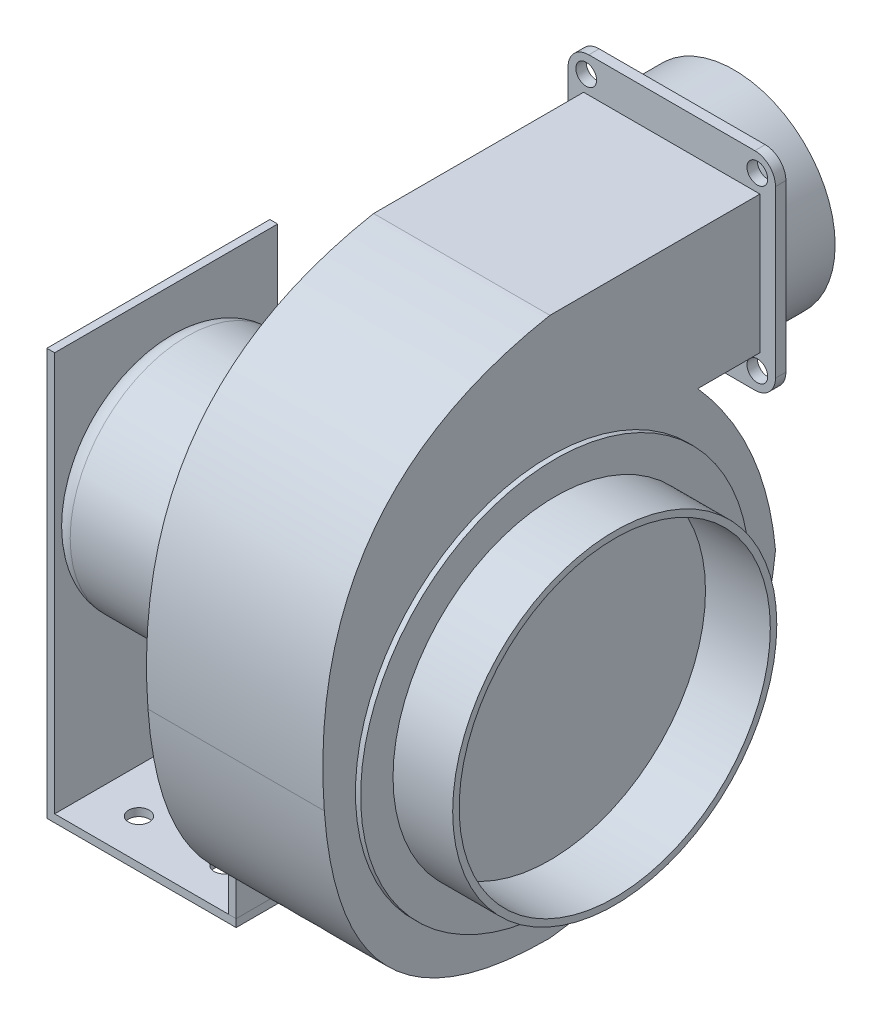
ISO-10303-21;
HEADER;
FILE_DESCRIPTION(('STEP AP214'),'2;1');
FILE_NAME('part.step','',(''),(''),'','','');
FILE_SCHEMA(('AUTOMOTIVE_DESIGN { 1 0 10303 214 1 1 1 1 }'));
ENDSEC;
DATA;
#1=APPLICATION_CONTEXT('core data for automotive mechanical design processes');
#2=APPLICATION_PROTOCOL_DEFINITION('international standard','automotive_design',2000,#1);
#3=PRODUCT_CONTEXT('',#1,'mechanical');
#4=PRODUCT('Part','Part','',(#3));
#5=PRODUCT_RELATED_PRODUCT_CATEGORY('part','',(#4));
#6=PRODUCT_DEFINITION_FORMATION('','',#4);
#7=PRODUCT_DEFINITION_CONTEXT('part definition',#1,'design');
#8=PRODUCT_DEFINITION('design','',#6,#7);
#9=PRODUCT_DEFINITION_SHAPE('','',#8);
#10=(LENGTH_UNIT() NAMED_UNIT(*) SI_UNIT(.MILLI.,.METRE.));
#11=(NAMED_UNIT(*) PLANE_ANGLE_UNIT() SI_UNIT($,.RADIAN.));
#12=(NAMED_UNIT(*) SI_UNIT($,.STERADIAN.) SOLID_ANGLE_UNIT());
#13=UNCERTAINTY_MEASURE_WITH_UNIT(LENGTH_MEASURE(1.E-05),#10,'distance_accuracy_value','');
#14=(GEOMETRIC_REPRESENTATION_CONTEXT(3) GLOBAL_UNCERTAINTY_ASSIGNED_CONTEXT((#13)) GLOBAL_UNIT_ASSIGNED_CONTEXT((#10,
#11,#12)) REPRESENTATION_CONTEXT('',''));
#15=CARTESIAN_POINT('',(0.,0.,0.));
#16=DIRECTION('',(0.,0.,1.));
#17=DIRECTION('',(1.,0.,0.));
#18=AXIS2_PLACEMENT_3D('',#15,#16,#17);
#19=CARTESIAN_POINT('',(-13.,-45.,-43.));
#20=DIRECTION('',(0.,0.,1.));
#21=DIRECTION('',(1.,0.,0.));
#22=AXIS2_PLACEMENT_3D('',#19,#20,#21);
#23=PLANE('',#22);
#24=DIRECTION('',(-1.,0.,0.));
#25=VECTOR('',#24,1.);
#26=CARTESIAN_POINT('',(-13.,-97.,-43.));
#27=LINE('',#26,#25);
#28=CARTESIAN_POINT('',(-9.99999999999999,-97.,-43.));
#29=VERTEX_POINT('',#28);
#30=CARTESIAN_POINT('',(-13.,-97.,-43.));
#31=VERTEX_POINT('',#30);
#32=EDGE_CURVE('E108',#29,#31,#27,.T.);
#33=ORIENTED_EDGE('',*,*,#32,.T.);
#34=DIRECTION('',(0.,-1.,0.));
#35=VECTOR('',#34,1.);
#36=CARTESIAN_POINT('',(-13.,-45.,-43.));
#37=LINE('',#36,#35);
#38=CARTESIAN_POINT('',(-13.,-45.,-43.));
#39=VERTEX_POINT('',#38);
#40=EDGE_CURVE('E12',#39,#31,#37,.T.);
#41=ORIENTED_EDGE('',*,*,#40,.F.);
#42=DIRECTION('',(-1.,0.,0.));
#43=VECTOR('',#42,1.);
#44=CARTESIAN_POINT('',(-13.,-45.,-43.));
#45=LINE('',#44,#43);
#46=CARTESIAN_POINT('',(-9.99999999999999,-45.,-43.));
#47=VERTEX_POINT('',#46);
#48=EDGE_CURVE('E96',#47,#39,#45,.T.);
#49=ORIENTED_EDGE('',*,*,#48,.F.);
#50=DIRECTION('',(0.,-1.,0.));
#51=VECTOR('',#50,1.);
#52=CARTESIAN_POINT('',(-9.99999999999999,-45.,-43.));
#53=LINE('',#52,#51);
#54=EDGE_CURVE('E104',#47,#29,#53,.T.);
#55=ORIENTED_EDGE('',*,*,#54,.T.);
#56=EDGE_LOOP('',(#33,#41,#49,#55));
#57=FACE_BOUND('',#56,.T.);
#58=ADVANCED_FACE('F45',(#57),#23,.F.);
#59=CARTESIAN_POINT('',(-13.,-45.,43.));
#60=DIRECTION('',(1.,0.,0.));
#61=DIRECTION('',(0.,0.,-1.));
#62=AXIS2_PLACEMENT_3D('',#59,#60,#61);
#63=PLANE('',#62);
#64=DIRECTION('',(0.,0.,1.));
#65=VECTOR('',#64,1.);
#66=CARTESIAN_POINT('',(-13.,-97.,43.));
#67=LINE('',#66,#65);
#68=CARTESIAN_POINT('',(-13.,-97.,43.));
#69=VERTEX_POINT('',#68);
#70=EDGE_CURVE('E100',#31,#69,#67,.T.);
#71=ORIENTED_EDGE('',*,*,#70,.T.);
#72=DIRECTION('',(0.,-1.,0.));
#73=VECTOR('',#72,1.);
#74=CARTESIAN_POINT('',(-13.,-45.,43.));
#75=LINE('',#74,#73);
#76=CARTESIAN_POINT('',(-13.,-45.,43.));
#77=VERTEX_POINT('',#76);
#78=EDGE_CURVE('E53',#77,#69,#75,.T.);
#79=ORIENTED_EDGE('',*,*,#78,.F.);
#80=DIRECTION('',(0.,0.,1.));
#81=VECTOR('',#80,1.);
#82=CARTESIAN_POINT('',(-13.,-45.,43.));
#83=LINE('',#82,#81);
#84=EDGE_CURVE('E91',#39,#77,#83,.T.);
#85=ORIENTED_EDGE('',*,*,#84,.F.);
#86=ORIENTED_EDGE('',*,*,#40,.T.);
#87=EDGE_LOOP('',(#71,#79,#85,#86));
#88=FACE_BOUND('',#87,.T.);
#89=ADVANCED_FACE('F99',(#88),#63,.F.);
#90=CARTESIAN_POINT('',(-9.99999999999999,-45.,43.));
#91=DIRECTION('',(0.,0.,-1.));
#92=DIRECTION('',(-1.,0.,0.));
#93=AXIS2_PLACEMENT_3D('',#90,#91,#92);
#94=PLANE('',#93);
#95=DIRECTION('',(1.,0.,0.));
#96=VECTOR('',#95,1.);
#97=CARTESIAN_POINT('',(-9.99999999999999,-97.,43.));
#98=LINE('',#97,#96);
#99=CARTESIAN_POINT('',(-9.99999999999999,-97.,43.));
#100=VERTEX_POINT('',#99);
#101=EDGE_CURVE('E78',#69,#100,#98,.T.);
#102=ORIENTED_EDGE('',*,*,#101,.T.);
#103=DIRECTION('',(0.,-1.,0.));
#104=VECTOR('',#103,1.);
#105=CARTESIAN_POINT('',(-9.99999999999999,-45.,43.));
#106=LINE('',#105,#104);
#107=CARTESIAN_POINT('',(-9.99999999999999,-45.,43.));
#108=VERTEX_POINT('',#107);
#109=EDGE_CURVE('E101',#108,#100,#106,.T.);
#110=ORIENTED_EDGE('',*,*,#109,.F.);
#111=DIRECTION('',(1.,0.,0.));
#112=VECTOR('',#111,1.);
#113=CARTESIAN_POINT('',(-9.99999999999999,-45.,43.));
#114=LINE('',#113,#112);
#115=EDGE_CURVE('E94',#77,#108,#114,.T.);
#116=ORIENTED_EDGE('',*,*,#115,.F.);
#117=ORIENTED_EDGE('',*,*,#78,.T.);
#118=EDGE_LOOP('',(#102,#110,#116,#117));
#119=FACE_BOUND('',#118,.T.);
#120=ADVANCED_FACE('F102',(#119),#94,.F.);
#121=CARTESIAN_POINT('',(-9.99999999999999,-45.,-43.));
#122=DIRECTION('',(-1.,0.,0.));
#123=DIRECTION('',(0.,0.,1.));
#124=AXIS2_PLACEMENT_3D('',#121,#122,#123);
#125=PLANE('',#124);
#126=DIRECTION('',(0.,0.,-1.));
#127=VECTOR('',#126,1.);
#128=CARTESIAN_POINT('',(-9.99999999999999,-97.,-43.));
#129=LINE('',#128,#127);
#130=EDGE_CURVE('E84',#100,#29,#129,.T.);
#131=ORIENTED_EDGE('',*,*,#130,.T.);
#132=ORIENTED_EDGE('',*,*,#54,.F.);
#133=DIRECTION('',(0.,0.,-1.));
#134=VECTOR('',#133,1.);
#135=CARTESIAN_POINT('',(-9.99999999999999,-45.,-43.));
#136=LINE('',#135,#134);
#137=EDGE_CURVE('E61',#108,#47,#136,.T.);
#138=ORIENTED_EDGE('',*,*,#137,.F.);
#139=ORIENTED_EDGE('',*,*,#109,.T.);
#140=EDGE_LOOP('',(#131,#132,#138,#139));
#141=FACE_BOUND('',#140,.T.);
#142=ADVANCED_FACE('F115',(#141),#125,.F.);
#143=CARTESIAN_POINT('',(0.,-45.,0.));
#144=DIRECTION('',(0.,-1.,0.));
#145=DIRECTION('',(0.,0.,-1.));
#146=AXIS2_PLACEMENT_3D('',#143,#144,#145);
#147=PLANE('',#146);
#148=ORIENTED_EDGE('',*,*,#48,.T.);
#149=ORIENTED_EDGE('',*,*,#84,.T.);
#150=ORIENTED_EDGE('',*,*,#115,.T.);
#151=ORIENTED_EDGE('',*,*,#137,.T.);
#152=EDGE_LOOP('',(#148,#149,#150,#151));
#153=FACE_BOUND('',#152,.T.);
#154=ADVANCED_FACE('F92',(#153),#147,.F.);
#155=CARTESIAN_POINT('',(0.,-97.,0.));
#156=DIRECTION('',(0.,-1.,0.));
#157=DIRECTION('',(0.,0.,-1.));
#158=AXIS2_PLACEMENT_3D('',#155,#156,#157);
#159=PLANE('',#158);
#160=ORIENTED_EDGE('',*,*,#32,.F.);
#161=ORIENTED_EDGE('',*,*,#130,.F.);
#162=ORIENTED_EDGE('',*,*,#101,.F.);
#163=ORIENTED_EDGE('',*,*,#70,.F.);
#164=EDGE_LOOP('',(#160,#161,#162,#163));
#165=FACE_BOUND('',#164,.T.);
#166=ADVANCED_FACE('F118',(#165),#159,.T.);
#167=CLOSED_SHELL('',(#58,#89,#120,#142,#154,#166));
#168=MANIFOLD_SOLID_BREP('B2',#167);
#169=CARTESIAN_POINT('',(-80.,0.,0.));
#170=DIRECTION('',(-1.,0.,0.));
#171=DIRECTION('',(0.,0.,1.));
#172=AXIS2_PLACEMENT_3D('',#169,#170,#171);
#173=PLANE('',#172);
#174=CARTESIAN_POINT('',(-80.,0.,0.));
#175=DIRECTION('',(-1.,0.,0.));
#176=DIRECTION('',(0.,0.,1.));
#177=AXIS2_PLACEMENT_3D('',#174,#175,#176);
#178=CIRCLE('',#177,37.);
#179=CARTESIAN_POINT('',(-80.,0.,37.));
#180=VERTEX_POINT('',#179);
#181=EDGE_CURVE('E177',#180,#180,#178,.T.);
#182=ORIENTED_EDGE('',*,*,#181,.T.);
#183=EDGE_LOOP('',(#182));
#184=FACE_BOUND('',#183,.T.);
#185=DIRECTION('',(0.,0.,1.));
#186=VECTOR('',#185,1.);
#187=CARTESIAN_POINT('',(-80.,-97.,-43.));
#188=LINE('',#187,#186);
#189=CARTESIAN_POINT('',(-80.,-97.,-43.));
#190=VERTEX_POINT('',#189);
#191=CARTESIAN_POINT('',(-80.,-97.,43.));
#192=VERTEX_POINT('',#191);
#193=EDGE_CURVE('E184',#190,#192,#188,.T.);
#194=ORIENTED_EDGE('',*,*,#193,.F.);
#195=DIRECTION('',(0.,-1.,0.));
#196=VECTOR('',#195,1.);
#197=CARTESIAN_POINT('',(-80.,57.,-43.));
#198=LINE('',#197,#196);
#199=CARTESIAN_POINT('',(-80.,57.,-43.));
#200=VERTEX_POINT('',#199);
#201=EDGE_CURVE('E376',#200,#190,#198,.T.);
#202=ORIENTED_EDGE('',*,*,#201,.F.);
#203=DIRECTION('',(0.,0.,-1.));
#204=VECTOR('',#203,1.);
#205=CARTESIAN_POINT('',(-80.,57.,43.));
#206=LINE('',#205,#204);
#207=CARTESIAN_POINT('',(-80.,57.,43.));
#208=VERTEX_POINT('',#207);
#209=EDGE_CURVE('E381',#208,#200,#206,.T.);
#210=ORIENTED_EDGE('',*,*,#209,.F.);
#211=DIRECTION('',(0.,1.,0.));
#212=VECTOR('',#211,1.);
#213=CARTESIAN_POINT('',(-80.,-100.,43.));
#214=LINE('',#213,#212);
#215=EDGE_CURVE('E388',#192,#208,#214,.T.);
#216=ORIENTED_EDGE('',*,*,#215,.F.);
#217=EDGE_LOOP('',(#194,#202,#210,#216));
#218=FACE_BOUND('',#217,.T.);
#219=ADVANCED_FACE('F169',(#184,#218),#173,.F.);
#220=CARTESIAN_POINT('',(0.,82.6886323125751,69.0577918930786));
#221=DIRECTION('',(1.,0.,0.));
#222=DIRECTION('',(0.,0.,-1.));
#223=AXIS2_PLACEMENT_3D('',#220,#221,#222);
#224=PLANE('',#223);
#225=CARTESIAN_POINT('',(0.,122.,0.));
#226=CARTESIAN_POINT('',(0.,104.37726462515,94.6155837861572));
#227=CARTESIAN_POINT('',(0.,0.,87.));
#228=B_SPLINE_CURVE_WITH_KNOTS('',2,(#225,#226,#227),.UNSPECIFIED.,.F.,.F.,(3,3),(0.,1.),.UNSPECIFIED.);
#229=CARTESIAN_POINT('',(0.,122.,0.));
#230=VERTEX_POINT('',#229);
#231=CARTESIAN_POINT('',(0.,0.,87.));
#232=VERTEX_POINT('',#231);
#233=EDGE_CURVE('E524',#230,#232,#228,.T.);
#234=ORIENTED_EDGE('',*,*,#233,.F.);
#235=DIRECTION('',(0.,0.,1.));
#236=VECTOR('',#235,1.);
#237=CARTESIAN_POINT('',(0.,122.,0.));
#238=LINE('',#237,#236);
#239=CARTESIAN_POINT('',(0.,122.,-81.));
#240=VERTEX_POINT('',#239);
#241=EDGE_CURVE('E532',#240,#230,#238,.T.);
#242=ORIENTED_EDGE('',*,*,#241,.F.);
#243=DIRECTION('',(0.,1.,0.));
#244=VECTOR('',#243,1.);
#245=CARTESIAN_POINT('',(0.,122.,-81.));
#246=LINE('',#245,#244);
#247=CARTESIAN_POINT('',(0.,69.,-81.));
#248=VERTEX_POINT('',#247);
#249=EDGE_CURVE('E608',#248,#240,#246,.T.);
#250=ORIENTED_EDGE('',*,*,#249,.F.);
#251=DIRECTION('',(0.,0.,-1.));
#252=VECTOR('',#251,1.);
#253=CARTESIAN_POINT('',(0.,69.,-57.));
#254=LINE('',#253,#252);
#255=CARTESIAN_POINT('',(0.,69.,-57.));
#256=VERTEX_POINT('',#255);
#257=EDGE_CURVE('E603',#256,#248,#254,.T.);
#258=ORIENTED_EDGE('',*,*,#257,.F.);
#259=CARTESIAN_POINT('',(0.,0.,-87.));
#260=CARTESIAN_POINT('',(0.,39.1492189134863,-83.3975281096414));
#261=CARTESIAN_POINT('',(0.,69.,-57.));
#262=B_SPLINE_CURVE_WITH_KNOTS('',2,(#259,#260,#261),.UNSPECIFIED.,.F.,.F.,(3,3),(0.,1.),.UNSPECIFIED.);
#263=CARTESIAN_POINT('',(0.,0.,-87.));
#264=VERTEX_POINT('',#263);
#265=EDGE_CURVE('E596',#264,#256,#262,.T.);
#266=ORIENTED_EDGE('',*,*,#265,.F.);
#267=CARTESIAN_POINT('',(0.,-86.,0.));
#268=CARTESIAN_POINT('',(0.,-76.7496858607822,-78.2157903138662));
#269=CARTESIAN_POINT('',(0.,0.,-87.));
#270=B_SPLINE_CURVE_WITH_KNOTS('',2,(#267,#268,#269),.UNSPECIFIED.,.F.,.F.,(3,3),(0.,1.),.UNSPECIFIED.);
#271=CARTESIAN_POINT('',(0.,-86.,0.));
#272=VERTEX_POINT('',#271);
#273=EDGE_CURVE('E589',#272,#264,#270,.T.);
#274=ORIENTED_EDGE('',*,*,#273,.F.);
#275=CARTESIAN_POINT('',(0.,0.,87.));
#276=CARTESIAN_POINT('',(0.,-86.2609930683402,80.7209110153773));
#277=CARTESIAN_POINT('',(0.,-86.,0.));
#278=B_SPLINE_CURVE_WITH_KNOTS('',2,(#275,#276,#277),.UNSPECIFIED.,.F.,.F.,(3,3),(0.,1.),.UNSPECIFIED.);
#279=EDGE_CURVE('E582',#232,#272,#278,.T.);
#280=ORIENTED_EDGE('',*,*,#279,.F.);
#281=EDGE_LOOP('',(#234,#242,#250,#258,#266,#274,#280));
#282=FACE_BOUND('',#281,.T.);
#283=CARTESIAN_POINT('',(0.,0.,0.));
#284=DIRECTION('',(1.,0.,0.));
#285=DIRECTION('',(0.,0.,-1.));
#286=AXIS2_PLACEMENT_3D('',#283,#284,#285);
#287=CIRCLE('',#286,45.);
#288=CARTESIAN_POINT('',(0.,0.,-45.));
#289=VERTEX_POINT('',#288);
#290=EDGE_CURVE('E646',#289,#289,#287,.F.);
#291=ORIENTED_EDGE('',*,*,#290,.F.);
#292=EDGE_LOOP('',(#291));
#293=FACE_BOUND('',#292,.T.);
#294=ADVANCED_FACE('F667',(#282,#293),#224,.F.);
#295=CARTESIAN_POINT('',(68.,82.6886323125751,69.0577918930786));
#296=DIRECTION('',(1.,0.,0.));
#297=DIRECTION('',(0.,0.,-1.));
#298=AXIS2_PLACEMENT_3D('',#295,#296,#297);
#299=PLANE('',#298);
#300=CARTESIAN_POINT('',(68.,122.,0.));
#301=CARTESIAN_POINT('',(68.,104.37726462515,94.6155837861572));
#302=CARTESIAN_POINT('',(68.,0.,87.));
#303=B_SPLINE_CURVE_WITH_KNOTS('',2,(#300,#301,#302),.UNSPECIFIED.,.F.,.F.,(3,3),(0.,1.),.UNSPECIFIED.);
#304=CARTESIAN_POINT('',(68.,122.,0.));
#305=VERTEX_POINT('',#304);
#306=CARTESIAN_POINT('',(68.,0.,87.));
#307=VERTEX_POINT('',#306);
#308=EDGE_CURVE('E525',#305,#307,#303,.T.);
#309=ORIENTED_EDGE('',*,*,#308,.T.);
#310=CARTESIAN_POINT('',(68.,0.,87.));
#311=CARTESIAN_POINT('',(68.,-86.2609930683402,80.7209110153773));
#312=CARTESIAN_POINT('',(68.,-86.,0.));
#313=B_SPLINE_CURVE_WITH_KNOTS('',2,(#310,#311,#312),.UNSPECIFIED.,.F.,.F.,(3,3),(0.,1.),.UNSPECIFIED.);
#314=CARTESIAN_POINT('',(68.,-86.,0.));
#315=VERTEX_POINT('',#314);
#316=EDGE_CURVE('E531',#307,#315,#313,.T.);
#317=ORIENTED_EDGE('',*,*,#316,.T.);
#318=CARTESIAN_POINT('',(68.,-86.,0.));
#319=CARTESIAN_POINT('',(68.,-76.7496858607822,-78.2157903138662));
#320=CARTESIAN_POINT('',(68.,0.,-87.));
#321=B_SPLINE_CURVE_WITH_KNOTS('',2,(#318,#319,#320),.UNSPECIFIED.,.F.,.F.,(3,3),(0.,1.),.UNSPECIFIED.);
#322=CARTESIAN_POINT('',(68.,0.,-87.));
#323=VERTEX_POINT('',#322);
#324=EDGE_CURVE('E556',#315,#323,#321,.T.);
#325=ORIENTED_EDGE('',*,*,#324,.T.);
#326=CARTESIAN_POINT('',(68.,0.,-87.));
#327=CARTESIAN_POINT('',(68.,39.1492189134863,-83.3975281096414));
#328=CARTESIAN_POINT('',(68.,69.,-57.));
#329=B_SPLINE_CURVE_WITH_KNOTS('',2,(#326,#327,#328),.UNSPECIFIED.,.F.,.F.,(3,3),(0.,1.),.UNSPECIFIED.);
#330=CARTESIAN_POINT('',(68.,69.,-57.));
#331=VERTEX_POINT('',#330);
#332=EDGE_CURVE('E560',#323,#331,#329,.T.);
#333=ORIENTED_EDGE('',*,*,#332,.T.);
#334=DIRECTION('',(0.,0.,-1.));
#335=VECTOR('',#334,1.);
#336=CARTESIAN_POINT('',(68.,69.,-57.));
#337=LINE('',#336,#335);
#338=CARTESIAN_POINT('',(68.,69.,-81.));
#339=VERTEX_POINT('',#338);
#340=EDGE_CURVE('E568',#331,#339,#337,.T.);
#341=ORIENTED_EDGE('',*,*,#340,.T.);
#342=DIRECTION('',(0.,1.,0.));
#343=VECTOR('',#342,1.);
#344=CARTESIAN_POINT('',(68.,122.,-81.));
#345=LINE('',#344,#343);
#346=CARTESIAN_POINT('',(68.,122.,-81.));
#347=VERTEX_POINT('',#346);
#348=EDGE_CURVE('E573',#339,#347,#345,.T.);
#349=ORIENTED_EDGE('',*,*,#348,.T.);
#350=DIRECTION('',(0.,0.,1.));
#351=VECTOR('',#350,1.);
#352=CARTESIAN_POINT('',(68.,122.,0.));
#353=LINE('',#352,#351);
#354=EDGE_CURVE('E575',#347,#305,#353,.T.);
#355=ORIENTED_EDGE('',*,*,#354,.T.);
#356=EDGE_LOOP('',(#309,#317,#325,#333,#341,#349,#355));
#357=FACE_BOUND('',#356,.T.);
#358=CARTESIAN_POINT('',(68.,0.,0.));
#359=DIRECTION('',(1.,0.,0.));
#360=DIRECTION('',(0.,0.,-1.));
#361=AXIS2_PLACEMENT_3D('',#358,#359,#360);
#362=CIRCLE('',#361,75.);
#363=CARTESIAN_POINT('',(68.,0.,-75.));
#364=VERTEX_POINT('',#363);
#365=EDGE_CURVE('E399',#364,#364,#362,.T.);
#366=ORIENTED_EDGE('',*,*,#365,.F.);
#367=EDGE_LOOP('',(#366));
#368=FACE_BOUND('',#367,.T.);
#369=ADVANCED_FACE('F672',(#357,#368),#299,.T.);
#370=CARTESIAN_POINT('',(2.,127.5,-85.));
#371=DIRECTION('',(0.,0.,1.));
#372=DIRECTION('',(1.,0.,0.));
#373=AXIS2_PLACEMENT_3D('',#370,#371,#372);
#374=PLANE('',#373);
#375=CARTESIAN_POINT('',(67.,62.5,-85.));
#376=DIRECTION('',(0.,0.,-1.));
#377=DIRECTION('',(-1.,0.,0.));
#378=AXIS2_PLACEMENT_3D('',#375,#376,#377);
#379=CIRCLE('',#378,4.00000000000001);
#380=CARTESIAN_POINT('',(63.,62.5,-85.));
#381=VERTEX_POINT('',#380);
#382=EDGE_CURVE('E445',#381,#381,#379,.T.);
#383=ORIENTED_EDGE('',*,*,#382,.F.);
#384=EDGE_LOOP('',(#383));
#385=FACE_BOUND('',#384,.T.);
#386=CARTESIAN_POINT('',(1.00000000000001,62.5,-85.));
#387=DIRECTION('',(0.,0.,-1.));
#388=DIRECTION('',(-1.,0.,0.));
#389=AXIS2_PLACEMENT_3D('',#386,#387,#388);
#390=CIRCLE('',#389,4.);
#391=CARTESIAN_POINT('',(-2.99999999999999,62.5,-85.));
#392=VERTEX_POINT('',#391);
#393=EDGE_CURVE('E454',#392,#392,#390,.T.);
#394=ORIENTED_EDGE('',*,*,#393,.F.);
#395=EDGE_LOOP('',(#394));
#396=FACE_BOUND('',#395,.T.);
#397=CARTESIAN_POINT('',(1.00000000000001,128.5,-85.));
#398=DIRECTION('',(0.,0.,-1.));
#399=DIRECTION('',(-1.,0.,0.));
#400=AXIS2_PLACEMENT_3D('',#397,#398,#399);
#401=CIRCLE('',#400,4.);
#402=CARTESIAN_POINT('',(-2.99999999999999,128.5,-85.));
#403=VERTEX_POINT('',#402);
#404=EDGE_CURVE('E458',#403,#403,#401,.T.);
#405=ORIENTED_EDGE('',*,*,#404,.F.);
#406=EDGE_LOOP('',(#405));
#407=FACE_BOUND('',#406,.T.);
#408=CARTESIAN_POINT('',(67.,128.5,-85.));
#409=DIRECTION('',(0.,0.,-1.));
#410=DIRECTION('',(-1.,0.,0.));
#411=AXIS2_PLACEMENT_3D('',#408,#409,#410);
#412=CIRCLE('',#411,4.00000000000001);
#413=CARTESIAN_POINT('',(63.,128.5,-85.));
#414=VERTEX_POINT('',#413);
#415=EDGE_CURVE('E462',#414,#414,#412,.T.);
#416=ORIENTED_EDGE('',*,*,#415,.F.);
#417=EDGE_LOOP('',(#416));
#418=FACE_BOUND('',#417,.T.);
#419=CARTESIAN_POINT('',(2.,127.5,-85.));
#420=DIRECTION('',(0.,0.,-1.));
#421=DIRECTION('',(1.,0.,0.));
#422=AXIS2_PLACEMENT_3D('',#419,#420,#421);
#423=CIRCLE('',#422,8.);
#424=CARTESIAN_POINT('',(-6.,127.5,-85.));
#425=VERTEX_POINT('',#424);
#426=CARTESIAN_POINT('',(2.00000000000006,135.5,-85.));
#427=VERTEX_POINT('',#426);
#428=EDGE_CURVE('E466',#425,#427,#423,.T.);
#429=ORIENTED_EDGE('',*,*,#428,.T.);
#430=DIRECTION('',(1.,0.,0.));
#431=VECTOR('',#430,1.);
#432=CARTESIAN_POINT('',(65.9999999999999,135.5,-85.));
#433=LINE('',#432,#431);
#434=CARTESIAN_POINT('',(65.9999999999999,135.5,-85.));
#435=VERTEX_POINT('',#434);
#436=EDGE_CURVE('E469',#427,#435,#433,.T.);
#437=ORIENTED_EDGE('',*,*,#436,.T.);
#438=CARTESIAN_POINT('',(66.,127.5,-85.));
#439=DIRECTION('',(0.,0.,-1.));
#440=DIRECTION('',(1.,0.,0.));
#441=AXIS2_PLACEMENT_3D('',#438,#439,#440);
#442=CIRCLE('',#441,8.);
#443=CARTESIAN_POINT('',(74.,127.5,-85.));
#444=VERTEX_POINT('',#443);
#445=EDGE_CURVE('E472',#435,#444,#442,.T.);
#446=ORIENTED_EDGE('',*,*,#445,.T.);
#447=DIRECTION('',(0.,-1.,0.));
#448=VECTOR('',#447,1.);
#449=CARTESIAN_POINT('',(74.,63.5000000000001,-85.));
#450=LINE('',#449,#448);
#451=CARTESIAN_POINT('',(74.,63.5000000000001,-85.));
#452=VERTEX_POINT('',#451);
#453=EDGE_CURVE('E474',#444,#452,#450,.T.);
#454=ORIENTED_EDGE('',*,*,#453,.T.);
#455=CARTESIAN_POINT('',(66.,63.5,-85.));
#456=DIRECTION('',(0.,0.,-1.));
#457=DIRECTION('',(1.,0.,0.));
#458=AXIS2_PLACEMENT_3D('',#455,#456,#457);
#459=CIRCLE('',#458,7.99999999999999);
#460=CARTESIAN_POINT('',(65.9999999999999,55.5,-85.));
#461=VERTEX_POINT('',#460);
#462=EDGE_CURVE('E476',#452,#461,#459,.T.);
#463=ORIENTED_EDGE('',*,*,#462,.T.);
#464=DIRECTION('',(-1.,0.,0.));
#465=VECTOR('',#464,1.);
#466=CARTESIAN_POINT('',(65.9999999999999,55.5,-85.));
#467=LINE('',#466,#465);
#468=CARTESIAN_POINT('',(2.00000000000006,55.5,-85.));
#469=VERTEX_POINT('',#468);
#470=EDGE_CURVE('E478',#461,#469,#467,.T.);
#471=ORIENTED_EDGE('',*,*,#470,.T.);
#472=CARTESIAN_POINT('',(2.,63.5,-85.));
#473=DIRECTION('',(0.,0.,-1.));
#474=DIRECTION('',(-1.,0.,0.));
#475=AXIS2_PLACEMENT_3D('',#472,#473,#474);
#476=CIRCLE('',#475,8.);
#477=CARTESIAN_POINT('',(-6.,63.5000000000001,-85.));
#478=VERTEX_POINT('',#477);
#479=EDGE_CURVE('E480',#469,#478,#476,.T.);
#480=ORIENTED_EDGE('',*,*,#479,.T.);
#481=DIRECTION('',(0.,1.,0.));
#482=VECTOR('',#481,1.);
#483=CARTESIAN_POINT('',(-6.,63.5000000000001,-85.));
#484=LINE('',#483,#482);
#485=EDGE_CURVE('E482',#478,#425,#484,.T.);
#486=ORIENTED_EDGE('',*,*,#485,.T.);
#487=EDGE_LOOP('',(#429,#437,#446,#454,#463,#471,#480,#486));
#488=FACE_BOUND('',#487,.T.);
#489=CARTESIAN_POINT('',(34.,95.5,-85.));
#490=DIRECTION('',(0.,0.,1.));
#491=DIRECTION('',(1.,0.,0.));
#492=AXIS2_PLACEMENT_3D('',#489,#490,#491);
#493=CIRCLE('',#492,39.);
#494=CARTESIAN_POINT('',(73.,95.5,-85.));
#495=VERTEX_POINT('',#494);
#496=EDGE_CURVE('E632',#495,#495,#493,.F.);
#497=ORIENTED_EDGE('',*,*,#496,.F.);
#498=EDGE_LOOP('',(#497));
#499=FACE_BOUND('',#498,.T.);
#500=ADVANCED_FACE('F544',(#385,#396,#407,#418,#488,#499),#374,.F.);
#501=DIRECTION('',(-1.,0.,0.));
#502=VECTOR('',#501,1.);
#503=SURFACE_OF_LINEAR_EXTRUSION('',#303,#502);
#504=ORIENTED_EDGE('',*,*,#233,.T.);
#505=DIRECTION('',(-1.,0.,0.));
#506=VECTOR('',#505,1.);
#507=CARTESIAN_POINT('',(68.,0.,87.));
#508=LINE('',#507,#506);
#509=EDGE_CURVE('E629',#307,#232,#508,.T.);
#510=ORIENTED_EDGE('',*,*,#509,.F.);
#511=ORIENTED_EDGE('',*,*,#308,.F.);
#512=DIRECTION('',(-1.,0.,0.));
#513=VECTOR('',#512,1.);
#514=CARTESIAN_POINT('',(68.,122.,0.));
#515=LINE('',#514,#513);
#516=EDGE_CURVE('E577',#305,#230,#515,.T.);
#517=ORIENTED_EDGE('',*,*,#516,.T.);
#518=EDGE_LOOP('',(#504,#510,#511,#517));
#519=FACE_BOUND('',#518,.T.);
#520=ADVANCED_FACE('F540',(#519),#503,.F.);
#521=DIRECTION('',(-1.,0.,0.));
#522=VECTOR('',#521,1.);
#523=SURFACE_OF_LINEAR_EXTRUSION('',#313,#522);
#524=ORIENTED_EDGE('',*,*,#279,.T.);
#525=DIRECTION('',(-1.,0.,0.));
#526=VECTOR('',#525,1.);
#527=CARTESIAN_POINT('',(68.,-86.,0.));
#528=LINE('',#527,#526);
#529=EDGE_CURVE('E626',#315,#272,#528,.T.);
#530=ORIENTED_EDGE('',*,*,#529,.F.);
#531=ORIENTED_EDGE('',*,*,#316,.F.);
#532=ORIENTED_EDGE('',*,*,#509,.T.);
#533=EDGE_LOOP('',(#524,#530,#531,#532));
#534=FACE_BOUND('',#533,.T.);
#535=ADVANCED_FACE('F543',(#534),#523,.F.);
#536=DIRECTION('',(-1.,0.,0.));
#537=VECTOR('',#536,1.);
#538=SURFACE_OF_LINEAR_EXTRUSION('',#321,#537);
#539=ORIENTED_EDGE('',*,*,#273,.T.);
#540=DIRECTION('',(-1.,0.,0.));
#541=VECTOR('',#540,1.);
#542=CARTESIAN_POINT('',(68.,0.,-87.));
#543=LINE('',#542,#541);
#544=EDGE_CURVE('E623',#323,#264,#543,.T.);
#545=ORIENTED_EDGE('',*,*,#544,.F.);
#546=ORIENTED_EDGE('',*,*,#324,.F.);
#547=ORIENTED_EDGE('',*,*,#529,.T.);
#548=EDGE_LOOP('',(#539,#545,#546,#547));
#549=FACE_BOUND('',#548,.T.);
#550=ADVANCED_FACE('F548',(#549),#538,.F.);
#551=DIRECTION('',(-1.,0.,0.));
#552=VECTOR('',#551,1.);
#553=SURFACE_OF_LINEAR_EXTRUSION('',#329,#552);
#554=ORIENTED_EDGE('',*,*,#265,.T.);
#555=DIRECTION('',(-1.,0.,0.));
#556=VECTOR('',#555,1.);
#557=CARTESIAN_POINT('',(68.,69.,-57.));
#558=LINE('',#557,#556);
#559=EDGE_CURVE('E620',#331,#256,#558,.T.);
#560=ORIENTED_EDGE('',*,*,#559,.F.);
#561=ORIENTED_EDGE('',*,*,#332,.F.);
#562=ORIENTED_EDGE('',*,*,#544,.T.);
#563=EDGE_LOOP('',(#554,#560,#561,#562));
#564=FACE_BOUND('',#563,.T.);
#565=ADVANCED_FACE('F552',(#564),#553,.F.);
#566=CARTESIAN_POINT('',(68.,69.,-57.));
#567=DIRECTION('',(0.,1.,0.));
#568=DIRECTION('',(0.,0.,1.));
#569=AXIS2_PLACEMENT_3D('',#566,#567,#568);
#570=PLANE('',#569);
#571=ORIENTED_EDGE('',*,*,#257,.T.);
#572=DIRECTION('',(-1.,0.,0.));
#573=VECTOR('',#572,1.);
#574=CARTESIAN_POINT('',(68.,69.,-81.));
#575=LINE('',#574,#573);
#576=EDGE_CURVE('E617',#339,#248,#575,.T.);
#577=ORIENTED_EDGE('',*,*,#576,.F.);
#578=ORIENTED_EDGE('',*,*,#340,.F.);
#579=ORIENTED_EDGE('',*,*,#559,.T.);
#580=EDGE_LOOP('',(#571,#577,#578,#579));
#581=FACE_BOUND('',#580,.T.);
#582=ADVANCED_FACE('F800',(#581),#570,.F.);
#583=CARTESIAN_POINT('',(68.,122.,0.));
#584=DIRECTION('',(0.,-1.,0.));
#585=DIRECTION('',(0.,0.,-1.));
#586=AXIS2_PLACEMENT_3D('',#583,#584,#585);
#587=PLANE('',#586);
#588=ORIENTED_EDGE('',*,*,#241,.T.);
#589=ORIENTED_EDGE('',*,*,#516,.F.);
#590=ORIENTED_EDGE('',*,*,#354,.F.);
#591=DIRECTION('',(-1.,0.,0.));
#592=VECTOR('',#591,1.);
#593=CARTESIAN_POINT('',(68.,122.,-81.));
#594=LINE('',#593,#592);
#595=EDGE_CURVE('E614',#347,#240,#594,.T.);
#596=ORIENTED_EDGE('',*,*,#595,.T.);
#597=EDGE_LOOP('',(#588,#589,#590,#596));
#598=FACE_BOUND('',#597,.T.);
#599=ADVANCED_FACE('F794',(#598),#587,.F.);
#600=CARTESIAN_POINT('',(2.,127.5,-85.));
#601=DIRECTION('',(0.,0.,1.));
#602=DIRECTION('',(1.,0.,0.));
#603=AXIS2_PLACEMENT_3D('',#600,#601,#602);
#604=CYLINDRICAL_SURFACE('',#603,8.);
#605=CARTESIAN_POINT('',(2.,127.5,-81.));
#606=DIRECTION('',(0.,0.,-1.));
#607=DIRECTION('',(1.,0.,0.));
#608=AXIS2_PLACEMENT_3D('',#605,#606,#607);
#609=CIRCLE('',#608,8.);
#610=CARTESIAN_POINT('',(-6.,127.5,-81.));
#611=VERTEX_POINT('',#610);
#612=CARTESIAN_POINT('',(2.00000000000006,135.5,-81.));
#613=VERTEX_POINT('',#612);
#614=EDGE_CURVE('E485',#611,#613,#609,.T.);
#615=ORIENTED_EDGE('',*,*,#614,.T.);
#616=DIRECTION('',(0.,0.,1.));
#617=VECTOR('',#616,1.);
#618=CARTESIAN_POINT('',(2.00000000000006,135.5,-85.));
#619=LINE('',#618,#617);
#620=EDGE_CURVE('E521',#427,#613,#619,.T.);
#621=ORIENTED_EDGE('',*,*,#620,.F.);
#622=ORIENTED_EDGE('',*,*,#428,.F.);
#623=DIRECTION('',(0.,0.,1.));
#624=VECTOR('',#623,1.);
#625=CARTESIAN_POINT('',(-6.,127.5,-85.));
#626=LINE('',#625,#624);
#627=EDGE_CURVE('E484',#425,#611,#626,.T.);
#628=ORIENTED_EDGE('',*,*,#627,.T.);
#629=EDGE_LOOP('',(#615,#621,#622,#628));
#630=FACE_BOUND('',#629,.T.);
#631=ADVANCED_FACE('F790',(#630),#604,.T.);
#632=CARTESIAN_POINT('',(65.9999999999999,135.5,-85.));
#633=DIRECTION('',(0.,-1.,0.));
#634=DIRECTION('',(0.,0.,-1.));
#635=AXIS2_PLACEMENT_3D('',#632,#633,#634);
#636=PLANE('',#635);
#637=DIRECTION('',(1.,0.,0.));
#638=VECTOR('',#637,1.);
#639=CARTESIAN_POINT('',(65.9999999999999,135.5,-81.));
#640=LINE('',#639,#638);
#641=CARTESIAN_POINT('',(65.9999999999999,135.5,-81.));
#642=VERTEX_POINT('',#641);
#643=EDGE_CURVE('E488',#613,#642,#640,.T.);
#644=ORIENTED_EDGE('',*,*,#643,.T.);
#645=DIRECTION('',(0.,0.,1.));
#646=VECTOR('',#645,1.);
#647=CARTESIAN_POINT('',(65.9999999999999,135.5,-85.));
#648=LINE('',#647,#646);
#649=EDGE_CURVE('E518',#435,#642,#648,.T.);
#650=ORIENTED_EDGE('',*,*,#649,.F.);
#651=ORIENTED_EDGE('',*,*,#436,.F.);
#652=ORIENTED_EDGE('',*,*,#620,.T.);
#653=EDGE_LOOP('',(#644,#650,#651,#652));
#654=FACE_BOUND('',#653,.T.);
#655=ADVANCED_FACE('F786',(#654),#636,.F.);
#656=CARTESIAN_POINT('',(66.,127.5,-85.));
#657=DIRECTION('',(0.,0.,1.));
#658=DIRECTION('',(1.,0.,0.));
#659=AXIS2_PLACEMENT_3D('',#656,#657,#658);
#660=CYLINDRICAL_SURFACE('',#659,8.);
#661=CARTESIAN_POINT('',(66.,127.5,-81.));
#662=DIRECTION('',(0.,0.,-1.));
#663=DIRECTION('',(1.,0.,0.));
#664=AXIS2_PLACEMENT_3D('',#661,#662,#663);
#665=CIRCLE('',#664,8.);
#666=CARTESIAN_POINT('',(74.,127.5,-81.));
#667=VERTEX_POINT('',#666);
#668=EDGE_CURVE('E490',#642,#667,#665,.T.);
#669=ORIENTED_EDGE('',*,*,#668,.T.);
#670=DIRECTION('',(0.,0.,1.));
#671=VECTOR('',#670,1.);
#672=CARTESIAN_POINT('',(74.,127.5,-85.));
#673=LINE('',#672,#671);
#674=EDGE_CURVE('E515',#444,#667,#673,.T.);
#675=ORIENTED_EDGE('',*,*,#674,.F.);
#676=ORIENTED_EDGE('',*,*,#445,.F.);
#677=ORIENTED_EDGE('',*,*,#649,.T.);
#678=EDGE_LOOP('',(#669,#675,#676,#677));
#679=FACE_BOUND('',#678,.T.);
#680=ADVANCED_FACE('F782',(#679),#660,.T.);
#681=CARTESIAN_POINT('',(74.,63.5000000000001,-85.));
#682=DIRECTION('',(-1.,0.,0.));
#683=DIRECTION('',(0.,0.,1.));
#684=AXIS2_PLACEMENT_3D('',#681,#682,#683);
#685=PLANE('',#684);
#686=DIRECTION('',(0.,-1.,0.));
#687=VECTOR('',#686,1.);
#688=CARTESIAN_POINT('',(74.,63.5000000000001,-81.));
#689=LINE('',#688,#687);
#690=CARTESIAN_POINT('',(74.,63.5000000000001,-81.));
#691=VERTEX_POINT('',#690);
#692=EDGE_CURVE('E492',#667,#691,#689,.T.);
#693=ORIENTED_EDGE('',*,*,#692,.T.);
#694=DIRECTION('',(0.,0.,1.));
#695=VECTOR('',#694,1.);
#696=CARTESIAN_POINT('',(74.,63.5000000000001,-85.));
#697=LINE('',#696,#695);
#698=EDGE_CURVE('E512',#452,#691,#697,.T.);
#699=ORIENTED_EDGE('',*,*,#698,.F.);
#700=ORIENTED_EDGE('',*,*,#453,.F.);
#701=ORIENTED_EDGE('',*,*,#674,.T.);
#702=EDGE_LOOP('',(#693,#699,#700,#701));
#703=FACE_BOUND('',#702,.T.);
#704=ADVANCED_FACE('F778',(#703),#685,.F.);
#705=CARTESIAN_POINT('',(66.,63.5,-85.));
#706=DIRECTION('',(0.,0.,1.));
#707=DIRECTION('',(1.,0.,0.));
#708=AXIS2_PLACEMENT_3D('',#705,#706,#707);
#709=CYLINDRICAL_SURFACE('',#708,7.99999999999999);
#710=CARTESIAN_POINT('',(66.,63.5,-81.));
#711=DIRECTION('',(0.,0.,-1.));
#712=DIRECTION('',(1.,0.,0.));
#713=AXIS2_PLACEMENT_3D('',#710,#711,#712);
#714=CIRCLE('',#713,7.99999999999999);
#715=CARTESIAN_POINT('',(65.9999999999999,55.5,-81.));
#716=VERTEX_POINT('',#715);
#717=EDGE_CURVE('E494',#691,#716,#714,.T.);
#718=ORIENTED_EDGE('',*,*,#717,.T.);
#719=DIRECTION('',(0.,0.,1.));
#720=VECTOR('',#719,1.);
#721=CARTESIAN_POINT('',(65.9999999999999,55.5,-85.));
#722=LINE('',#721,#720);
#723=EDGE_CURVE('E509',#461,#716,#722,.T.);
#724=ORIENTED_EDGE('',*,*,#723,.F.);
#725=ORIENTED_EDGE('',*,*,#462,.F.);
#726=ORIENTED_EDGE('',*,*,#698,.T.);
#727=EDGE_LOOP('',(#718,#724,#725,#726));
#728=FACE_BOUND('',#727,.T.);
#729=ADVANCED_FACE('F774',(#728),#709,.T.);
#730=CARTESIAN_POINT('',(65.9999999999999,55.5,-85.));
#731=DIRECTION('',(0.,1.,0.));
#732=DIRECTION('',(0.,0.,1.));
#733=AXIS2_PLACEMENT_3D('',#730,#731,#732);
#734=PLANE('',#733);
#735=DIRECTION('',(-1.,0.,0.));
#736=VECTOR('',#735,1.);
#737=CARTESIAN_POINT('',(65.9999999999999,55.5,-81.));
#738=LINE('',#737,#736);
#739=CARTESIAN_POINT('',(2.00000000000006,55.5,-81.));
#740=VERTEX_POINT('',#739);
#741=EDGE_CURVE('E496',#716,#740,#738,.T.);
#742=ORIENTED_EDGE('',*,*,#741,.T.);
#743=DIRECTION('',(0.,0.,1.));
#744=VECTOR('',#743,1.);
#745=CARTESIAN_POINT('',(2.00000000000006,55.5,-85.));
#746=LINE('',#745,#744);
#747=EDGE_CURVE('E506',#469,#740,#746,.T.);
#748=ORIENTED_EDGE('',*,*,#747,.F.);
#749=ORIENTED_EDGE('',*,*,#470,.F.);
#750=ORIENTED_EDGE('',*,*,#723,.T.);
#751=EDGE_LOOP('',(#742,#748,#749,#750));
#752=FACE_BOUND('',#751,.T.);
#753=ADVANCED_FACE('F770',(#752),#734,.F.);
#754=CARTESIAN_POINT('',(2.,63.5,-85.));
#755=DIRECTION('',(0.,0.,1.));
#756=DIRECTION('',(1.,0.,0.));
#757=AXIS2_PLACEMENT_3D('',#754,#755,#756);
#758=CYLINDRICAL_SURFACE('',#757,8.);
#759=CARTESIAN_POINT('',(2.,63.5,-81.));
#760=DIRECTION('',(0.,0.,-1.));
#761=DIRECTION('',(-1.,0.,0.));
#762=AXIS2_PLACEMENT_3D('',#759,#760,#761);
#763=CIRCLE('',#762,8.);
#764=CARTESIAN_POINT('',(-6.,63.5000000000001,-81.));
#765=VERTEX_POINT('',#764);
#766=EDGE_CURVE('E498',#740,#765,#763,.T.);
#767=ORIENTED_EDGE('',*,*,#766,.T.);
#768=DIRECTION('',(0.,0.,1.));
#769=VECTOR('',#768,1.);
#770=CARTESIAN_POINT('',(-6.,63.5000000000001,-85.));
#771=LINE('',#770,#769);
#772=EDGE_CURVE('E503',#478,#765,#771,.T.);
#773=ORIENTED_EDGE('',*,*,#772,.F.);
#774=ORIENTED_EDGE('',*,*,#479,.F.);
#775=ORIENTED_EDGE('',*,*,#747,.T.);
#776=EDGE_LOOP('',(#767,#773,#774,#775));
#777=FACE_BOUND('',#776,.T.);
#778=ADVANCED_FACE('F766',(#777),#758,.T.);
#779=CARTESIAN_POINT('',(-6.,63.5000000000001,-85.));
#780=DIRECTION('',(1.,0.,0.));
#781=DIRECTION('',(0.,0.,-1.));
#782=AXIS2_PLACEMENT_3D('',#779,#780,#781);
#783=PLANE('',#782);
#784=DIRECTION('',(0.,1.,0.));
#785=VECTOR('',#784,1.);
#786=CARTESIAN_POINT('',(-6.,63.5000000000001,-81.));
#787=LINE('',#786,#785);
#788=EDGE_CURVE('E470',#765,#611,#787,.T.);
#789=ORIENTED_EDGE('',*,*,#788,.T.);
#790=ORIENTED_EDGE('',*,*,#627,.F.);
#791=ORIENTED_EDGE('',*,*,#485,.F.);
#792=ORIENTED_EDGE('',*,*,#772,.T.);
#793=EDGE_LOOP('',(#789,#790,#791,#792));
#794=FACE_BOUND('',#793,.T.);
#795=ADVANCED_FACE('F762',(#794),#783,.F.);
#796=CARTESIAN_POINT('',(2.,127.5,-81.));
#797=DIRECTION('',(0.,0.,1.));
#798=DIRECTION('',(1.,0.,0.));
#799=AXIS2_PLACEMENT_3D('',#796,#797,#798);
#800=PLANE('',#799);
#801=CARTESIAN_POINT('',(67.,62.5,-81.));
#802=DIRECTION('',(0.,0.,1.));
#803=DIRECTION('',(1.,0.,0.));
#804=AXIS2_PLACEMENT_3D('',#801,#802,#803);
#805=CIRCLE('',#804,4.00000000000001);
#806=CARTESIAN_POINT('',(71.,62.5,-81.));
#807=VERTEX_POINT('',#806);
#808=EDGE_CURVE('E453',#807,#807,#805,.T.);
#809=ORIENTED_EDGE('',*,*,#808,.F.);
#810=EDGE_LOOP('',(#809));
#811=FACE_BOUND('',#810,.T.);
#812=CARTESIAN_POINT('',(1.00000000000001,62.5,-81.));
#813=DIRECTION('',(0.,0.,1.));
#814=DIRECTION('',(1.,0.,0.));
#815=AXIS2_PLACEMENT_3D('',#812,#813,#814);
#816=CIRCLE('',#815,4.);
#817=CARTESIAN_POINT('',(5.00000000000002,62.5,-81.));
#818=VERTEX_POINT('',#817);
#819=EDGE_CURVE('E457',#818,#818,#816,.T.);
#820=ORIENTED_EDGE('',*,*,#819,.F.);
#821=EDGE_LOOP('',(#820));
#822=FACE_BOUND('',#821,.T.);
#823=CARTESIAN_POINT('',(1.00000000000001,128.5,-81.));
#824=DIRECTION('',(0.,0.,1.));
#825=DIRECTION('',(1.,0.,0.));
#826=AXIS2_PLACEMENT_3D('',#823,#824,#825);
#827=CIRCLE('',#826,4.);
#828=CARTESIAN_POINT('',(5.00000000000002,128.5,-81.));
#829=VERTEX_POINT('',#828);
#830=EDGE_CURVE('E461',#829,#829,#827,.T.);
#831=ORIENTED_EDGE('',*,*,#830,.F.);
#832=EDGE_LOOP('',(#831));
#833=FACE_BOUND('',#832,.T.);
#834=CARTESIAN_POINT('',(67.,128.5,-81.));
#835=DIRECTION('',(0.,0.,1.));
#836=DIRECTION('',(1.,0.,0.));
#837=AXIS2_PLACEMENT_3D('',#834,#835,#836);
#838=CIRCLE('',#837,4.00000000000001);
#839=CARTESIAN_POINT('',(71.,128.5,-81.));
#840=VERTEX_POINT('',#839);
#841=EDGE_CURVE('E465',#840,#840,#838,.T.);
#842=ORIENTED_EDGE('',*,*,#841,.F.);
#843=EDGE_LOOP('',(#842));
#844=FACE_BOUND('',#843,.T.);
#845=ORIENTED_EDGE('',*,*,#595,.F.);
#846=ORIENTED_EDGE('',*,*,#348,.F.);
#847=ORIENTED_EDGE('',*,*,#576,.T.);
#848=ORIENTED_EDGE('',*,*,#249,.T.);
#849=EDGE_LOOP('',(#845,#846,#847,#848));
#850=FACE_BOUND('',#849,.T.);
#851=ORIENTED_EDGE('',*,*,#614,.F.);
#852=ORIENTED_EDGE('',*,*,#788,.F.);
#853=ORIENTED_EDGE('',*,*,#766,.F.);
#854=ORIENTED_EDGE('',*,*,#741,.F.);
#855=ORIENTED_EDGE('',*,*,#717,.F.);
#856=ORIENTED_EDGE('',*,*,#692,.F.);
#857=ORIENTED_EDGE('',*,*,#668,.F.);
#858=ORIENTED_EDGE('',*,*,#643,.F.);
#859=EDGE_LOOP('',(#851,#852,#853,#854,#855,#856,#857,#858));
#860=FACE_BOUND('',#859,.T.);
#861=ADVANCED_FACE('F755',(#811,#822,#833,#844,#850,#860),#800,.T.);
#862=CARTESIAN_POINT('',(67.,128.5,-80.));
#863=DIRECTION('',(0.,0.,-1.));
#864=DIRECTION('',(-1.,0.,0.));
#865=AXIS2_PLACEMENT_3D('',#862,#863,#864);
#866=CYLINDRICAL_SURFACE('',#865,4.00000000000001);
#867=ORIENTED_EDGE('',*,*,#841,.T.);
#868=EDGE_LOOP('',(#867));
#869=FACE_BOUND('',#868,.T.);
#870=ORIENTED_EDGE('',*,*,#415,.T.);
#871=EDGE_LOOP('',(#870));
#872=FACE_BOUND('',#871,.T.);
#873=ADVANCED_FACE('F751',(#869,#872),#866,.F.);
#874=CARTESIAN_POINT('',(1.00000000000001,128.5,-80.));
#875=DIRECTION('',(0.,0.,-1.));
#876=DIRECTION('',(-1.,0.,0.));
#877=AXIS2_PLACEMENT_3D('',#874,#875,#876);
#878=CYLINDRICAL_SURFACE('',#877,4.);
#879=ORIENTED_EDGE('',*,*,#830,.T.);
#880=EDGE_LOOP('',(#879));
#881=FACE_BOUND('',#880,.T.);
#882=ORIENTED_EDGE('',*,*,#404,.T.);
#883=EDGE_LOOP('',(#882));
#884=FACE_BOUND('',#883,.T.);
#885=ADVANCED_FACE('F747',(#881,#884),#878,.F.);
#886=CARTESIAN_POINT('',(1.00000000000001,62.5,-80.));
#887=DIRECTION('',(0.,0.,-1.));
#888=DIRECTION('',(-1.,0.,0.));
#889=AXIS2_PLACEMENT_3D('',#886,#887,#888);
#890=CYLINDRICAL_SURFACE('',#889,4.);
#891=ORIENTED_EDGE('',*,*,#819,.T.);
#892=EDGE_LOOP('',(#891));
#893=FACE_BOUND('',#892,.T.);
#894=ORIENTED_EDGE('',*,*,#393,.T.);
#895=EDGE_LOOP('',(#894));
#896=FACE_BOUND('',#895,.T.);
#897=ADVANCED_FACE('F743',(#893,#896),#890,.F.);
#898=CARTESIAN_POINT('',(67.,62.5,-80.));
#899=DIRECTION('',(0.,0.,-1.));
#900=DIRECTION('',(-1.,0.,0.));
#901=AXIS2_PLACEMENT_3D('',#898,#899,#900);
#902=CYLINDRICAL_SURFACE('',#901,4.00000000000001);
#903=ORIENTED_EDGE('',*,*,#808,.T.);
#904=EDGE_LOOP('',(#903));
#905=FACE_BOUND('',#904,.T.);
#906=ORIENTED_EDGE('',*,*,#382,.T.);
#907=EDGE_LOOP('',(#906));
#908=FACE_BOUND('',#907,.T.);
#909=ADVANCED_FACE('F718',(#905,#908),#902,.F.);
#910=CARTESIAN_POINT('',(34.,95.5,-105.));
#911=DIRECTION('',(0.,0.,-1.));
#912=DIRECTION('',(-1.,0.,0.));
#913=AXIS2_PLACEMENT_3D('',#910,#911,#912);
#914=PLANE('',#913);
#915=CARTESIAN_POINT('',(34.,95.5,-105.));
#916=DIRECTION('',(0.,0.,-1.));
#917=DIRECTION('',(-1.,0.,0.));
#918=AXIS2_PLACEMENT_3D('',#915,#916,#917);
#919=CIRCLE('',#918,39.);
#920=CARTESIAN_POINT('',(-5.,95.5,-105.));
#921=VERTEX_POINT('',#920);
#922=EDGE_CURVE('E415',#921,#921,#919,.T.);
#923=ORIENTED_EDGE('',*,*,#922,.T.);
#924=EDGE_LOOP('',(#923));
#925=FACE_BOUND('',#924,.T.);
#926=CARTESIAN_POINT('',(34.,95.5,-105.));
#927=DIRECTION('',(0.,0.,-1.));
#928=DIRECTION('',(-1.,0.,0.));
#929=AXIS2_PLACEMENT_3D('',#926,#927,#928);
#930=CIRCLE('',#929,37.);
#931=CARTESIAN_POINT('',(-3.,95.5,-105.));
#932=VERTEX_POINT('',#931);
#933=EDGE_CURVE('E412',#932,#932,#930,.T.);
#934=ORIENTED_EDGE('',*,*,#933,.F.);
#935=EDGE_LOOP('',(#934));
#936=FACE_BOUND('',#935,.T.);
#937=ADVANCED_FACE('F715',(#925,#936),#914,.T.);
#938=CARTESIAN_POINT('',(34.,95.5,-105.));
#939=DIRECTION('',(0.,0.,1.));
#940=DIRECTION('',(1.,0.,0.));
#941=AXIS2_PLACEMENT_3D('',#938,#939,#940);
#942=CYLINDRICAL_SURFACE('',#941,39.);
#943=ORIENTED_EDGE('',*,*,#922,.F.);
#944=EDGE_LOOP('',(#943));
#945=FACE_BOUND('',#944,.T.);
#946=ORIENTED_EDGE('',*,*,#496,.T.);
#947=EDGE_LOOP('',(#946));
#948=FACE_BOUND('',#947,.T.);
#949=ADVANCED_FACE('F713',(#945,#948),#942,.T.);
#950=CARTESIAN_POINT('',(34.,95.5,-105.));
#951=DIRECTION('',(0.,0.,1.));
#952=DIRECTION('',(1.,0.,0.));
#953=AXIS2_PLACEMENT_3D('',#950,#951,#952);
#954=CYLINDRICAL_SURFACE('',#953,37.);
#955=ORIENTED_EDGE('',*,*,#933,.T.);
#956=EDGE_LOOP('',(#955));
#957=FACE_BOUND('',#956,.T.);
#958=CARTESIAN_POINT('',(34.,95.5,-85.));
#959=DIRECTION('',(0.,0.,-1.));
#960=DIRECTION('',(-1.,0.,0.));
#961=AXIS2_PLACEMENT_3D('',#958,#959,#960);
#962=CIRCLE('',#961,37.);
#963=CARTESIAN_POINT('',(-3.,95.5,-85.));
#964=VERTEX_POINT('',#963);
#965=EDGE_CURVE('E411',#964,#964,#962,.T.);
#966=ORIENTED_EDGE('',*,*,#965,.F.);
#967=EDGE_LOOP('',(#966));
#968=FACE_BOUND('',#967,.T.);
#969=ADVANCED_FACE('F709',(#957,#968),#954,.F.);
#970=CARTESIAN_POINT('',(0.,0.,-5.));
#971=DIRECTION('',(0.,0.,1.));
#972=DIRECTION('',(1.,0.,0.));
#973=AXIS2_PLACEMENT_3D('',#970,#971,#972);
#974=PLANE('',#973);
#975=DIRECTION('',(0.,1.,0.));
#976=VECTOR('',#975,1.);
#977=CARTESIAN_POINT('',(8.00000000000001,69.5,-5.));
#978=LINE('',#977,#976);
#979=CARTESIAN_POINT('',(8.00000000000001,69.5,-5.));
#980=VERTEX_POINT('',#979);
#981=CARTESIAN_POINT('',(8.00000000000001,121.5,-5.));
#982=VERTEX_POINT('',#981);
#983=EDGE_CURVE('E420',#980,#982,#978,.T.);
#984=ORIENTED_EDGE('',*,*,#983,.T.);
#985=DIRECTION('',(1.,0.,0.));
#986=VECTOR('',#985,1.);
#987=CARTESIAN_POINT('',(60.,121.5,-5.));
#988=LINE('',#987,#986);
#989=CARTESIAN_POINT('',(60.,121.5,-5.));
#990=VERTEX_POINT('',#989);
#991=EDGE_CURVE('E423',#982,#990,#988,.T.);
#992=ORIENTED_EDGE('',*,*,#991,.T.);
#993=DIRECTION('',(0.,-1.,0.));
#994=VECTOR('',#993,1.);
#995=CARTESIAN_POINT('',(60.,69.5,-5.));
#996=LINE('',#995,#994);
#997=CARTESIAN_POINT('',(60.,69.5,-5.));
#998=VERTEX_POINT('',#997);
#999=EDGE_CURVE('E427',#990,#998,#996,.T.);
#1000=ORIENTED_EDGE('',*,*,#999,.T.);
#1001=DIRECTION('',(-1.,0.,0.));
#1002=VECTOR('',#1001,1.);
#1003=CARTESIAN_POINT('',(60.,69.5,-5.));
#1004=LINE('',#1003,#1002);
#1005=EDGE_CURVE('E430',#998,#980,#1004,.T.);
#1006=ORIENTED_EDGE('',*,*,#1005,.T.);
#1007=EDGE_LOOP('',(#984,#992,#1000,#1006));
#1008=FACE_BOUND('',#1007,.T.);
#1009=ADVANCED_FACE('F712',(#1008),#974,.F.);
#1010=CARTESIAN_POINT('',(60.,69.5,-5.));
#1011=DIRECTION('',(1.,0.,0.));
#1012=DIRECTION('',(0.,0.,-1.));
#1013=AXIS2_PLACEMENT_3D('',#1010,#1011,#1012);
#1014=PLANE('',#1013);
#1015=DIRECTION('',(0.,-1.,0.));
#1016=VECTOR('',#1015,1.);
#1017=CARTESIAN_POINT('',(60.,69.5,-85.));
#1018=LINE('',#1017,#1016);
#1019=CARTESIAN_POINT('',(60.,121.5,-85.));
#1020=VERTEX_POINT('',#1019);
#1021=CARTESIAN_POINT('',(60.,69.5,-85.));
#1022=VERTEX_POINT('',#1021);
#1023=EDGE_CURVE('E438',#1020,#1022,#1018,.T.);
#1024=ORIENTED_EDGE('',*,*,#1023,.T.);
#1025=DIRECTION('',(0.,0.,-1.));
#1026=VECTOR('',#1025,1.);
#1027=CARTESIAN_POINT('',(60.,69.5,-5.));
#1028=LINE('',#1027,#1026);
#1029=EDGE_CURVE('E446',#998,#1022,#1028,.T.);
#1030=ORIENTED_EDGE('',*,*,#1029,.F.);
#1031=ORIENTED_EDGE('',*,*,#999,.F.);
#1032=DIRECTION('',(0.,0.,-1.));
#1033=VECTOR('',#1032,1.);
#1034=CARTESIAN_POINT('',(60.,121.5,-5.));
#1035=LINE('',#1034,#1033);
#1036=EDGE_CURVE('E448',#990,#1020,#1035,.T.);
#1037=ORIENTED_EDGE('',*,*,#1036,.T.);
#1038=EDGE_LOOP('',(#1024,#1030,#1031,#1037));
#1039=FACE_BOUND('',#1038,.T.);
#1040=ADVANCED_FACE('F725',(#1039),#1014,.F.);
#1041=CARTESIAN_POINT('',(60.,69.5,-5.));
#1042=DIRECTION('',(0.,-1.,0.));
#1043=DIRECTION('',(0.,0.,-1.));
#1044=AXIS2_PLACEMENT_3D('',#1041,#1042,#1043);
#1045=PLANE('',#1044);
#1046=DIRECTION('',(-1.,0.,0.));
#1047=VECTOR('',#1046,1.);
#1048=CARTESIAN_POINT('',(60.,69.5,-85.));
#1049=LINE('',#1048,#1047);
#1050=CARTESIAN_POINT('',(8.00000000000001,69.5,-85.));
#1051=VERTEX_POINT('',#1050);
#1052=EDGE_CURVE('E424',#1022,#1051,#1049,.T.);
#1053=ORIENTED_EDGE('',*,*,#1052,.T.);
#1054=DIRECTION('',(0.,0.,-1.));
#1055=VECTOR('',#1054,1.);
#1056=CARTESIAN_POINT('',(8.00000000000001,69.5,-5.));
#1057=LINE('',#1056,#1055);
#1058=EDGE_CURVE('E443',#980,#1051,#1057,.T.);
#1059=ORIENTED_EDGE('',*,*,#1058,.F.);
#1060=ORIENTED_EDGE('',*,*,#1005,.F.);
#1061=ORIENTED_EDGE('',*,*,#1029,.T.);
#1062=EDGE_LOOP('',(#1053,#1059,#1060,#1061));
#1063=FACE_BOUND('',#1062,.T.);
#1064=ADVANCED_FACE('F727',(#1063),#1045,.F.);
#1065=CARTESIAN_POINT('',(8.00000000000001,69.5,-5.));
#1066=DIRECTION('',(-1.,0.,0.));
#1067=DIRECTION('',(0.,0.,1.));
#1068=AXIS2_PLACEMENT_3D('',#1065,#1066,#1067);
#1069=PLANE('',#1068);
#1070=DIRECTION('',(0.,1.,0.));
#1071=VECTOR('',#1070,1.);
#1072=CARTESIAN_POINT('',(8.00000000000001,69.5,-85.));
#1073=LINE('',#1072,#1071);
#1074=CARTESIAN_POINT('',(8.00000000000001,121.5,-85.));
#1075=VERTEX_POINT('',#1074);
#1076=EDGE_CURVE('E192',#1051,#1075,#1073,.T.);
#1077=ORIENTED_EDGE('',*,*,#1076,.T.);
#1078=DIRECTION('',(0.,0.,-1.));
#1079=VECTOR('',#1078,1.);
#1080=CARTESIAN_POINT('',(8.00000000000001,121.5,-5.));
#1081=LINE('',#1080,#1079);
#1082=EDGE_CURVE('E433',#982,#1075,#1081,.T.);
#1083=ORIENTED_EDGE('',*,*,#1082,.F.);
#1084=ORIENTED_EDGE('',*,*,#983,.F.);
#1085=ORIENTED_EDGE('',*,*,#1058,.T.);
#1086=EDGE_LOOP('',(#1077,#1083,#1084,#1085));
#1087=FACE_BOUND('',#1086,.T.);
#1088=ADVANCED_FACE('F730',(#1087),#1069,.F.);
#1089=CARTESIAN_POINT('',(60.,121.5,-5.));
#1090=DIRECTION('',(0.,1.,0.));
#1091=DIRECTION('',(0.,0.,1.));
#1092=AXIS2_PLACEMENT_3D('',#1089,#1090,#1091);
#1093=PLANE('',#1092);
#1094=DIRECTION('',(1.,0.,0.));
#1095=VECTOR('',#1094,1.);
#1096=CARTESIAN_POINT('',(60.,121.5,-85.));
#1097=LINE('',#1096,#1095);
#1098=EDGE_CURVE('E435',#1075,#1020,#1097,.T.);
#1099=ORIENTED_EDGE('',*,*,#1098,.T.);
#1100=ORIENTED_EDGE('',*,*,#1036,.F.);
#1101=ORIENTED_EDGE('',*,*,#991,.F.);
#1102=ORIENTED_EDGE('',*,*,#1082,.T.);
#1103=EDGE_LOOP('',(#1099,#1100,#1101,#1102));
#1104=FACE_BOUND('',#1103,.T.);
#1105=ADVANCED_FACE('F735',(#1104),#1093,.F.);
#1106=ORIENTED_EDGE('',*,*,#965,.T.);
#1107=EDGE_LOOP('',(#1106));
#1108=FACE_BOUND('',#1107,.T.);
#1109=ORIENTED_EDGE('',*,*,#1098,.F.);
#1110=ORIENTED_EDGE('',*,*,#1076,.F.);
#1111=ORIENTED_EDGE('',*,*,#1052,.F.);
#1112=ORIENTED_EDGE('',*,*,#1023,.F.);
#1113=EDGE_LOOP('',(#1109,#1110,#1111,#1112));
#1114=FACE_BOUND('',#1113,.T.);
#1115=ADVANCED_FACE('F692',(#1108,#1114),#374,.F.);
#1116=CARTESIAN_POINT('',(70.,0.,0.));
#1117=DIRECTION('',(1.,0.,0.));
#1118=DIRECTION('',(0.,0.,-1.));
#1119=AXIS2_PLACEMENT_3D('',#1116,#1117,#1118);
#1120=PLANE('',#1119);
#1121=CARTESIAN_POINT('',(70.,0.,0.));
#1122=DIRECTION('',(1.,0.,0.));
#1123=DIRECTION('',(0.,0.,-1.));
#1124=AXIS2_PLACEMENT_3D('',#1121,#1122,#1123);
#1125=CIRCLE('',#1124,75.);
#1126=CARTESIAN_POINT('',(70.,0.,-75.));
#1127=VERTEX_POINT('',#1126);
#1128=EDGE_CURVE('E400',#1127,#1127,#1125,.T.);
#1129=ORIENTED_EDGE('',*,*,#1128,.T.);
#1130=EDGE_LOOP('',(#1129));
#1131=FACE_BOUND('',#1130,.T.);
#1132=CARTESIAN_POINT('',(70.,0.,0.));
#1133=DIRECTION('',(1.,0.,0.));
#1134=DIRECTION('',(0.,0.,-1.));
#1135=AXIS2_PLACEMENT_3D('',#1132,#1133,#1134);
#1136=CIRCLE('',#1135,62.5);
#1137=CARTESIAN_POINT('',(70.,0.,-62.5));
#1138=VERTEX_POINT('',#1137);
#1139=EDGE_CURVE('E396',#1138,#1138,#1136,.T.);
#1140=ORIENTED_EDGE('',*,*,#1139,.F.);
#1141=EDGE_LOOP('',(#1140));
#1142=FACE_BOUND('',#1141,.T.);
#1143=ADVANCED_FACE('F688',(#1131,#1142),#1120,.T.);
#1144=CARTESIAN_POINT('',(70.,0.,0.));
#1145=DIRECTION('',(-1.,0.,0.));
#1146=DIRECTION('',(0.,0.,1.));
#1147=AXIS2_PLACEMENT_3D('',#1144,#1145,#1146);
#1148=CYLINDRICAL_SURFACE('',#1147,75.);
#1149=ORIENTED_EDGE('',*,*,#1128,.F.);
#1150=EDGE_LOOP('',(#1149));
#1151=FACE_BOUND('',#1150,.T.);
#1152=ORIENTED_EDGE('',*,*,#365,.T.);
#1153=EDGE_LOOP('',(#1152));
#1154=FACE_BOUND('',#1153,.T.);
#1155=ADVANCED_FACE('F691',(#1151,#1154),#1148,.T.);
#1156=CARTESIAN_POINT('',(68.,0.,0.));
#1157=DIRECTION('',(1.,0.,0.));
#1158=DIRECTION('',(0.,0.,-1.));
#1159=AXIS2_PLACEMENT_3D('',#1156,#1157,#1158);
#1160=CIRCLE('',#1159,60.);
#1161=CARTESIAN_POINT('',(68.,0.,-60.));
#1162=VERTEX_POINT('',#1161);
#1163=EDGE_CURVE('E643',#1162,#1162,#1160,.F.);
#1164=ORIENTED_EDGE('',*,*,#1163,.F.);
#1165=EDGE_LOOP('',(#1164));
#1166=FACE_BOUND('',#1165,.T.);
#1167=ADVANCED_FACE('F696',(#1166),#299,.T.);
#1168=CARTESIAN_POINT('',(93.,0.,0.));
#1169=DIRECTION('',(-1.,0.,0.));
#1170=DIRECTION('',(0.,0.,1.));
#1171=AXIS2_PLACEMENT_3D('',#1168,#1169,#1170);
#1172=CYLINDRICAL_SURFACE('',#1171,60.);
#1173=CARTESIAN_POINT('',(93.,0.,0.));
#1174=DIRECTION('',(1.,0.,0.));
#1175=DIRECTION('',(0.,0.,-1.));
#1176=AXIS2_PLACEMENT_3D('',#1173,#1174,#1175);
#1177=CIRCLE('',#1176,60.);
#1178=CARTESIAN_POINT('',(93.,0.,-60.));
#1179=VERTEX_POINT('',#1178);
#1180=EDGE_CURVE('E403',#1179,#1179,#1177,.T.);
#1181=ORIENTED_EDGE('',*,*,#1180,.T.);
#1182=EDGE_LOOP('',(#1181));
#1183=FACE_BOUND('',#1182,.T.);
#1184=ORIENTED_EDGE('',*,*,#1163,.T.);
#1185=EDGE_LOOP('',(#1184));
#1186=FACE_BOUND('',#1185,.T.);
#1187=ADVANCED_FACE('F698',(#1183,#1186),#1172,.F.);
#1188=CARTESIAN_POINT('',(93.,0.,0.));
#1189=DIRECTION('',(1.,0.,0.));
#1190=DIRECTION('',(0.,0.,-1.));
#1191=AXIS2_PLACEMENT_3D('',#1188,#1189,#1190);
#1192=PLANE('',#1191);
#1193=CARTESIAN_POINT('',(93.,0.,0.));
#1194=DIRECTION('',(1.,0.,0.));
#1195=DIRECTION('',(0.,0.,-1.));
#1196=AXIS2_PLACEMENT_3D('',#1193,#1194,#1195);
#1197=CIRCLE('',#1196,62.5);
#1198=CARTESIAN_POINT('',(93.,0.,-62.5));
#1199=VERTEX_POINT('',#1198);
#1200=EDGE_CURVE('E408',#1199,#1199,#1197,.T.);
#1201=ORIENTED_EDGE('',*,*,#1200,.T.);
#1202=EDGE_LOOP('',(#1201));
#1203=FACE_BOUND('',#1202,.T.);
#1204=ORIENTED_EDGE('',*,*,#1180,.F.);
#1205=EDGE_LOOP('',(#1204));
#1206=FACE_BOUND('',#1205,.T.);
#1207=ADVANCED_FACE('F701',(#1203,#1206),#1192,.T.);
#1208=CARTESIAN_POINT('',(93.,0.,0.));
#1209=DIRECTION('',(-1.,0.,0.));
#1210=DIRECTION('',(0.,0.,1.));
#1211=AXIS2_PLACEMENT_3D('',#1208,#1209,#1210);
#1212=CYLINDRICAL_SURFACE('',#1211,62.5);
#1213=ORIENTED_EDGE('',*,*,#1139,.T.);
#1214=EDGE_LOOP('',(#1213));
#1215=FACE_BOUND('',#1214,.T.);
#1216=ORIENTED_EDGE('',*,*,#1200,.F.);
#1217=EDGE_LOOP('',(#1216));
#1218=FACE_BOUND('',#1217,.T.);
#1219=ADVANCED_FACE('F662',(#1215,#1218),#1212,.T.);
#1220=CARTESIAN_POINT('',(-80.,0.,0.));
#1221=DIRECTION('',(1.,0.,0.));
#1222=DIRECTION('',(0.,0.,-1.));
#1223=AXIS2_PLACEMENT_3D('',#1220,#1221,#1222);
#1224=CYLINDRICAL_SURFACE('',#1223,45.);
#1225=CARTESIAN_POINT('',(-72.,0.,0.));
#1226=DIRECTION('',(-1.,0.,0.));
#1227=DIRECTION('',(0.,0.,1.));
#1228=AXIS2_PLACEMENT_3D('',#1225,#1226,#1227);
#1229=CIRCLE('',#1228,45.);
#1230=CARTESIAN_POINT('',(-72.,0.,45.));
#1231=VERTEX_POINT('',#1230);
#1232=EDGE_CURVE('E43',#1231,#1231,#1229,.F.);
#1233=ORIENTED_EDGE('',*,*,#1232,.T.);
#1234=EDGE_LOOP('',(#1233));
#1235=FACE_BOUND('',#1234,.T.);
#1236=ORIENTED_EDGE('',*,*,#290,.T.);
#1237=EDGE_LOOP('',(#1236));
#1238=FACE_BOUND('',#1237,.T.);
#1239=ADVANCED_FACE('F654',(#1235,#1238),#1224,.T.);
#1240=CARTESIAN_POINT('',(-72.,0.,0.));
#1241=DIRECTION('',(-1.,0.,0.));
#1242=DIRECTION('',(0.,0.,1.));
#1243=AXIS2_PLACEMENT_3D('',#1240,#1241,#1242);
#1244=TOROIDAL_SURFACE('',#1243,37.,8.);
#1245=ORIENTED_EDGE('',*,*,#1232,.F.);
#1246=EDGE_LOOP('',(#1245));
#1247=FACE_BOUND('',#1246,.T.);
#1248=ORIENTED_EDGE('',*,*,#181,.F.);
#1249=EDGE_LOOP('',(#1248));
#1250=FACE_BOUND('',#1249,.T.);
#1251=ADVANCED_FACE('F171',(#1247,#1250),#1244,.T.);
#1252=CARTESIAN_POINT('',(-83.,57.,-43.));
#1253=DIRECTION('',(0.,0.,1.));
#1254=DIRECTION('',(0.,-1.,0.));
#1255=AXIS2_PLACEMENT_3D('',#1252,#1253,#1254);
#1256=PLANE('',#1255);
#1257=ORIENTED_EDGE('',*,*,#201,.T.);
#1258=DIRECTION('',(-1.,0.,0.));
#1259=VECTOR('',#1258,1.);
#1260=CARTESIAN_POINT('',(-9.99999999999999,-97.,-43.));
#1261=LINE('',#1260,#1259);
#1262=CARTESIAN_POINT('',(-9.99999999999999,-97.,-43.));
#1263=VERTEX_POINT('',#1262);
#1264=EDGE_CURVE('E373',#1263,#190,#1261,.T.);
#1265=ORIENTED_EDGE('',*,*,#1264,.F.);
#1266=DIRECTION('',(0.,1.,0.));
#1267=VECTOR('',#1266,1.);
#1268=CARTESIAN_POINT('',(-9.99999999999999,-100.,-43.));
#1269=LINE('',#1268,#1267);
#1270=CARTESIAN_POINT('',(-9.99999999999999,-100.,-43.));
#1271=VERTEX_POINT('',#1270);
#1272=EDGE_CURVE('E356',#1271,#1263,#1269,.T.);
#1273=ORIENTED_EDGE('',*,*,#1272,.F.);
#1274=DIRECTION('',(1.,0.,0.));
#1275=VECTOR('',#1274,1.);
#1276=CARTESIAN_POINT('',(-83.,-100.,-43.));
#1277=LINE('',#1276,#1275);
#1278=CARTESIAN_POINT('',(-83.,-100.,-43.));
#1279=VERTEX_POINT('',#1278);
#1280=EDGE_CURVE('E347',#1279,#1271,#1277,.T.);
#1281=ORIENTED_EDGE('',*,*,#1280,.F.);
#1282=DIRECTION('',(0.,-1.,0.));
#1283=VECTOR('',#1282,1.);
#1284=CARTESIAN_POINT('',(-83.,57.,-43.));
#1285=LINE('',#1284,#1283);
#1286=CARTESIAN_POINT('',(-83.,57.,-43.));
#1287=VERTEX_POINT('',#1286);
#1288=EDGE_CURVE('E377',#1287,#1279,#1285,.T.);
#1289=ORIENTED_EDGE('',*,*,#1288,.F.);
#1290=DIRECTION('',(1.,0.,0.));
#1291=VECTOR('',#1290,1.);
#1292=CARTESIAN_POINT('',(-83.,57.,-43.));
#1293=LINE('',#1292,#1291);
#1294=EDGE_CURVE('E386',#1287,#200,#1293,.T.);
#1295=ORIENTED_EDGE('',*,*,#1294,.T.);
#1296=EDGE_LOOP('',(#1257,#1265,#1273,#1281,#1289,#1295));
#1297=FACE_BOUND('',#1296,.T.);
#1298=ADVANCED_FACE('F653',(#1297),#1256,.F.);
#1299=CARTESIAN_POINT('',(-83.,-100.,-43.));
#1300=DIRECTION('',(0.,1.,0.));
#1301=DIRECTION('',(0.,0.,1.));
#1302=AXIS2_PLACEMENT_3D('',#1299,#1300,#1301);
#1303=PLANE('',#1302);
#1304=CARTESIAN_POINT('',(-63.,-100.,-27.5));
#1305=DIRECTION('',(0.,-1.,0.));
#1306=DIRECTION('',(0.,0.,-1.));
#1307=AXIS2_PLACEMENT_3D('',#1304,#1305,#1306);
#1308=CIRCLE('',#1307,4.00000000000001);
#1309=CARTESIAN_POINT('',(-63.,-100.,-31.5));
#1310=VERTEX_POINT('',#1309);
#1311=EDGE_CURVE('E1188',#1310,#1310,#1308,.T.);
#1312=ORIENTED_EDGE('',*,*,#1311,.F.);
#1313=EDGE_LOOP('',(#1312));
#1314=FACE_BOUND('',#1313,.T.);
#1315=CARTESIAN_POINT('',(-30.,-100.,-27.5));
#1316=DIRECTION('',(0.,-1.,0.));
#1317=DIRECTION('',(0.,0.,-1.));
#1318=AXIS2_PLACEMENT_3D('',#1315,#1316,#1317);
#1319=CIRCLE('',#1318,4.);
#1320=CARTESIAN_POINT('',(-30.,-100.,-31.5));
#1321=VERTEX_POINT('',#1320);
#1322=EDGE_CURVE('E1190',#1321,#1321,#1319,.T.);
#1323=ORIENTED_EDGE('',*,*,#1322,.F.);
#1324=EDGE_LOOP('',(#1323));
#1325=FACE_BOUND('',#1324,.T.);
#1326=CARTESIAN_POINT('',(-30.,-100.,27.5));
#1327=DIRECTION('',(0.,-1.,0.));
#1328=DIRECTION('',(0.,0.,-1.));
#1329=AXIS2_PLACEMENT_3D('',#1326,#1327,#1328);
#1330=CIRCLE('',#1329,4.);
#1331=CARTESIAN_POINT('',(-30.,-100.,23.5));
#1332=VERTEX_POINT('',#1331);
#1333=EDGE_CURVE('E1196',#1332,#1332,#1330,.T.);
#1334=ORIENTED_EDGE('',*,*,#1333,.F.);
#1335=EDGE_LOOP('',(#1334));
#1336=FACE_BOUND('',#1335,.T.);
#1337=CARTESIAN_POINT('',(-63.,-100.,27.5));
#1338=DIRECTION('',(0.,-1.,0.));
#1339=DIRECTION('',(0.,0.,-1.));
#1340=AXIS2_PLACEMENT_3D('',#1337,#1338,#1339);
#1341=CIRCLE('',#1340,4.00000000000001);
#1342=CARTESIAN_POINT('',(-63.,-100.,23.5));
#1343=VERTEX_POINT('',#1342);
#1344=EDGE_CURVE('E366',#1343,#1343,#1341,.T.);
#1345=ORIENTED_EDGE('',*,*,#1344,.F.);
#1346=EDGE_LOOP('',(#1345));
#1347=FACE_BOUND('',#1346,.T.);
#1348=ORIENTED_EDGE('',*,*,#1280,.T.);
#1349=DIRECTION('',(0.,0.,-1.));
#1350=VECTOR('',#1349,1.);
#1351=CARTESIAN_POINT('',(-9.99999999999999,-100.,43.));
#1352=LINE('',#1351,#1350);
#1353=CARTESIAN_POINT('',(-9.99999999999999,-100.,43.));
#1354=VERTEX_POINT('',#1353);
#1355=EDGE_CURVE('E351',#1354,#1271,#1352,.T.);
#1356=ORIENTED_EDGE('',*,*,#1355,.F.);
#1357=DIRECTION('',(1.,0.,0.));
#1358=VECTOR('',#1357,1.);
#1359=CARTESIAN_POINT('',(-83.,-100.,43.));
#1360=LINE('',#1359,#1358);
#1361=CARTESIAN_POINT('',(-83.,-100.,43.));
#1362=VERTEX_POINT('',#1361);
#1363=EDGE_CURVE('E338',#1362,#1354,#1360,.T.);
#1364=ORIENTED_EDGE('',*,*,#1363,.F.);
#1365=DIRECTION('',(0.,0.,1.));
#1366=VECTOR('',#1365,1.);
#1367=CARTESIAN_POINT('',(-83.,-100.,-43.));
#1368=LINE('',#1367,#1366);
#1369=EDGE_CURVE('E380',#1279,#1362,#1368,.T.);
#1370=ORIENTED_EDGE('',*,*,#1369,.F.);
#1371=EDGE_LOOP('',(#1348,#1356,#1364,#1370));
#1372=FACE_BOUND('',#1371,.T.);
#1373=ADVANCED_FACE('F352',(#1314,#1325,#1336,#1347,#1372),#1303,.F.);
#1374=CARTESIAN_POINT('',(-83.,-100.,43.));
#1375=DIRECTION('',(0.,0.,-1.));
#1376=DIRECTION('',(-1.,0.,0.));
#1377=AXIS2_PLACEMENT_3D('',#1374,#1375,#1376);
#1378=PLANE('',#1377);
#1379=ORIENTED_EDGE('',*,*,#1363,.T.);
#1380=DIRECTION('',(0.,-1.,0.));
#1381=VECTOR('',#1380,1.);
#1382=CARTESIAN_POINT('',(-9.99999999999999,-97.,43.));
#1383=LINE('',#1382,#1381);
#1384=CARTESIAN_POINT('',(-9.99999999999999,-97.,43.));
#1385=VERTEX_POINT('',#1384);
#1386=EDGE_CURVE('E343',#1385,#1354,#1383,.T.);
#1387=ORIENTED_EDGE('',*,*,#1386,.F.);
#1388=DIRECTION('',(-1.,0.,0.));
#1389=VECTOR('',#1388,1.);
#1390=CARTESIAN_POINT('',(-9.99999999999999,-97.,43.));
#1391=LINE('',#1390,#1389);
#1392=EDGE_CURVE('E370',#1385,#192,#1391,.T.);
#1393=ORIENTED_EDGE('',*,*,#1392,.T.);
#1394=ORIENTED_EDGE('',*,*,#215,.T.);
#1395=DIRECTION('',(1.,0.,0.));
#1396=VECTOR('',#1395,1.);
#1397=CARTESIAN_POINT('',(-83.,57.,43.));
#1398=LINE('',#1397,#1396);
#1399=CARTESIAN_POINT('',(-83.,57.,43.));
#1400=VERTEX_POINT('',#1399);
#1401=EDGE_CURVE('E348',#1400,#208,#1398,.T.);
#1402=ORIENTED_EDGE('',*,*,#1401,.F.);
#1403=DIRECTION('',(0.,1.,0.));
#1404=VECTOR('',#1403,1.);
#1405=CARTESIAN_POINT('',(-83.,-100.,43.));
#1406=LINE('',#1405,#1404);
#1407=EDGE_CURVE('E345',#1362,#1400,#1406,.T.);
#1408=ORIENTED_EDGE('',*,*,#1407,.F.);
#1409=EDGE_LOOP('',(#1379,#1387,#1393,#1394,#1402,#1408));
#1410=FACE_BOUND('',#1409,.T.);
#1411=ADVANCED_FACE('F340',(#1410),#1378,.F.);
#1412=CARTESIAN_POINT('',(-83.,57.,43.));
#1413=DIRECTION('',(0.,-1.,0.));
#1414=DIRECTION('',(0.,0.,-1.));
#1415=AXIS2_PLACEMENT_3D('',#1412,#1413,#1414);
#1416=PLANE('',#1415);
#1417=ORIENTED_EDGE('',*,*,#209,.T.);
#1418=ORIENTED_EDGE('',*,*,#1294,.F.);
#1419=DIRECTION('',(0.,0.,-1.));
#1420=VECTOR('',#1419,1.);
#1421=CARTESIAN_POINT('',(-83.,57.,43.));
#1422=LINE('',#1421,#1420);
#1423=EDGE_CURVE('E384',#1400,#1287,#1422,.T.);
#1424=ORIENTED_EDGE('',*,*,#1423,.F.);
#1425=ORIENTED_EDGE('',*,*,#1401,.T.);
#1426=EDGE_LOOP('',(#1417,#1418,#1424,#1425));
#1427=FACE_BOUND('',#1426,.T.);
#1428=ADVANCED_FACE('F679',(#1427),#1416,.F.);
#1429=CARTESIAN_POINT('',(-83.,0.,0.));
#1430=DIRECTION('',(-1.,0.,0.));
#1431=DIRECTION('',(0.,0.,1.));
#1432=AXIS2_PLACEMENT_3D('',#1429,#1430,#1431);
#1433=PLANE('',#1432);
#1434=ORIENTED_EDGE('',*,*,#1288,.T.);
#1435=ORIENTED_EDGE('',*,*,#1369,.T.);
#1436=ORIENTED_EDGE('',*,*,#1407,.T.);
#1437=ORIENTED_EDGE('',*,*,#1423,.T.);
#1438=EDGE_LOOP('',(#1434,#1435,#1436,#1437));
#1439=FACE_BOUND('',#1438,.T.);
#1440=ADVANCED_FACE('F677',(#1439),#1433,.T.);
#1441=CARTESIAN_POINT('',(-9.99999999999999,-97.,-43.));
#1442=DIRECTION('',(0.,-1.,0.));
#1443=DIRECTION('',(0.,0.,-1.));
#1444=AXIS2_PLACEMENT_3D('',#1441,#1442,#1443);
#1445=PLANE('',#1444);
#1446=CARTESIAN_POINT('',(-63.,-97.,-27.5));
#1447=DIRECTION('',(0.,-1.,0.));
#1448=DIRECTION('',(0.,0.,-1.));
#1449=AXIS2_PLACEMENT_3D('',#1446,#1447,#1448);
#1450=CIRCLE('',#1449,4.00000000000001);
#1451=CARTESIAN_POINT('',(-63.,-97.,-31.5));
#1452=VERTEX_POINT('',#1451);
#1453=EDGE_CURVE('E1185',#1452,#1452,#1450,.T.);
#1454=ORIENTED_EDGE('',*,*,#1453,.T.);
#1455=EDGE_LOOP('',(#1454));
#1456=FACE_BOUND('',#1455,.T.);
#1457=CARTESIAN_POINT('',(-30.,-97.,-27.5));
#1458=DIRECTION('',(0.,-1.,0.));
#1459=DIRECTION('',(0.,0.,-1.));
#1460=AXIS2_PLACEMENT_3D('',#1457,#1458,#1459);
#1461=CIRCLE('',#1460,4.);
#1462=CARTESIAN_POINT('',(-30.,-97.,-31.5));
#1463=VERTEX_POINT('',#1462);
#1464=EDGE_CURVE('E1193',#1463,#1463,#1461,.T.);
#1465=ORIENTED_EDGE('',*,*,#1464,.T.);
#1466=EDGE_LOOP('',(#1465));
#1467=FACE_BOUND('',#1466,.T.);
#1468=CARTESIAN_POINT('',(-30.,-97.,27.5));
#1469=DIRECTION('',(0.,-1.,0.));
#1470=DIRECTION('',(0.,0.,-1.));
#1471=AXIS2_PLACEMENT_3D('',#1468,#1469,#1470);
#1472=CIRCLE('',#1471,4.);
#1473=CARTESIAN_POINT('',(-30.,-97.,23.5));
#1474=VERTEX_POINT('',#1473);
#1475=EDGE_CURVE('E1199',#1474,#1474,#1472,.T.);
#1476=ORIENTED_EDGE('',*,*,#1475,.T.);
#1477=EDGE_LOOP('',(#1476));
#1478=FACE_BOUND('',#1477,.T.);
#1479=CARTESIAN_POINT('',(-63.,-97.,27.5));
#1480=DIRECTION('',(0.,-1.,0.));
#1481=DIRECTION('',(0.,0.,-1.));
#1482=AXIS2_PLACEMENT_3D('',#1479,#1480,#1481);
#1483=CIRCLE('',#1482,4.00000000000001);
#1484=CARTESIAN_POINT('',(-63.,-97.,23.5));
#1485=VERTEX_POINT('',#1484);
#1486=EDGE_CURVE('E363',#1485,#1485,#1483,.T.);
#1487=ORIENTED_EDGE('',*,*,#1486,.T.);
#1488=EDGE_LOOP('',(#1487));
#1489=FACE_BOUND('',#1488,.T.);
#1490=ORIENTED_EDGE('',*,*,#193,.T.);
#1491=ORIENTED_EDGE('',*,*,#1392,.F.);
#1492=DIRECTION('',(0.,0.,1.));
#1493=VECTOR('',#1492,1.);
#1494=CARTESIAN_POINT('',(-9.99999999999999,-97.,-43.));
#1495=LINE('',#1494,#1493);
#1496=EDGE_CURVE('E360',#1263,#1385,#1495,.T.);
#1497=ORIENTED_EDGE('',*,*,#1496,.F.);
#1498=ORIENTED_EDGE('',*,*,#1264,.T.);
#1499=EDGE_LOOP('',(#1490,#1491,#1497,#1498));
#1500=FACE_BOUND('',#1499,.T.);
#1501=ADVANCED_FACE('F1115',(#1456,#1467,#1478,#1489,#1500),#1445,.F.);
#1502=CARTESIAN_POINT('',(-9.99999999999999,0.,0.));
#1503=DIRECTION('',(1.,0.,0.));
#1504=DIRECTION('',(0.,0.,-1.));
#1505=AXIS2_PLACEMENT_3D('',#1502,#1503,#1504);
#1506=PLANE('',#1505);
#1507=ORIENTED_EDGE('',*,*,#1386,.T.);
#1508=ORIENTED_EDGE('',*,*,#1355,.T.);
#1509=ORIENTED_EDGE('',*,*,#1272,.T.);
#1510=ORIENTED_EDGE('',*,*,#1496,.T.);
#1511=EDGE_LOOP('',(#1507,#1508,#1509,#1510));
#1512=FACE_BOUND('',#1511,.T.);
#1513=ADVANCED_FACE('F358',(#1512),#1506,.T.);
#1514=CARTESIAN_POINT('',(-63.,-97.,27.5));
#1515=DIRECTION('',(0.,-1.,0.));
#1516=DIRECTION('',(0.,0.,-1.));
#1517=AXIS2_PLACEMENT_3D('',#1514,#1515,#1516);
#1518=CYLINDRICAL_SURFACE('',#1517,4.00000000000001);
#1519=ORIENTED_EDGE('',*,*,#1486,.F.);
#1520=EDGE_LOOP('',(#1519));
#1521=FACE_BOUND('',#1520,.T.);
#1522=ORIENTED_EDGE('',*,*,#1344,.T.);
#1523=EDGE_LOOP('',(#1522));
#1524=FACE_BOUND('',#1523,.T.);
#1525=ADVANCED_FACE('F1129',(#1521,#1524),#1518,.F.);
#1526=CARTESIAN_POINT('',(-30.,-97.,27.5));
#1527=DIRECTION('',(0.,-1.,0.));
#1528=DIRECTION('',(0.,0.,-1.));
#1529=AXIS2_PLACEMENT_3D('',#1526,#1527,#1528);
#1530=CYLINDRICAL_SURFACE('',#1529,4.);
#1531=ORIENTED_EDGE('',*,*,#1475,.F.);
#1532=EDGE_LOOP('',(#1531));
#1533=FACE_BOUND('',#1532,.T.);
#1534=ORIENTED_EDGE('',*,*,#1333,.T.);
#1535=EDGE_LOOP('',(#1534));
#1536=FACE_BOUND('',#1535,.T.);
#1537=ADVANCED_FACE('F1148',(#1533,#1536),#1530,.F.);
#1538=CARTESIAN_POINT('',(-30.,-97.,-27.5));
#1539=DIRECTION('',(0.,-1.,0.));
#1540=DIRECTION('',(0.,0.,-1.));
#1541=AXIS2_PLACEMENT_3D('',#1538,#1539,#1540);
#1542=CYLINDRICAL_SURFACE('',#1541,4.);
#1543=ORIENTED_EDGE('',*,*,#1464,.F.);
#1544=EDGE_LOOP('',(#1543));
#1545=FACE_BOUND('',#1544,.T.);
#1546=ORIENTED_EDGE('',*,*,#1322,.T.);
#1547=EDGE_LOOP('',(#1546));
#1548=FACE_BOUND('',#1547,.T.);
#1549=ADVANCED_FACE('F1158',(#1545,#1548),#1542,.F.);
#1550=CARTESIAN_POINT('',(-63.,-97.,-27.5));
#1551=DIRECTION('',(0.,-1.,0.));
#1552=DIRECTION('',(0.,0.,-1.));
#1553=AXIS2_PLACEMENT_3D('',#1550,#1551,#1552);
#1554=CYLINDRICAL_SURFACE('',#1553,4.00000000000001);
#1555=ORIENTED_EDGE('',*,*,#1453,.F.);
#1556=EDGE_LOOP('',(#1555));
#1557=FACE_BOUND('',#1556,.T.);
#1558=ORIENTED_EDGE('',*,*,#1311,.T.);
#1559=EDGE_LOOP('',(#1558));
#1560=FACE_BOUND('',#1559,.T.);
#1561=ADVANCED_FACE('F1168',(#1557,#1560),#1554,.F.);
#1562=CLOSED_SHELL('',(#219,#294,#369,#500,#520,#535,#550,#565,#582,#599,#631,#655,#680,#704,
#729,#753,#778,#795,#861,#873,#885,#897,#909,#937,#949,#969,#1009,#1040,#1064,#1088,#1105,#1115,
#1143,#1155,#1167,#1187,#1207,#1219,#1239,#1251,#1298,#1373,#1411,#1428,#1440,#1501,#1513,#1525,
#1537,#1549,#1561));
#1563=MANIFOLD_SOLID_BREP('B6',#1562);
#1564=ADVANCED_BREP_SHAPE_REPRESENTATION('',(#18,#168,#1563),#14);
#1565=SHAPE_DEFINITION_REPRESENTATION(#9,#1564);
ENDSEC;
END-ISO-10303-21;
